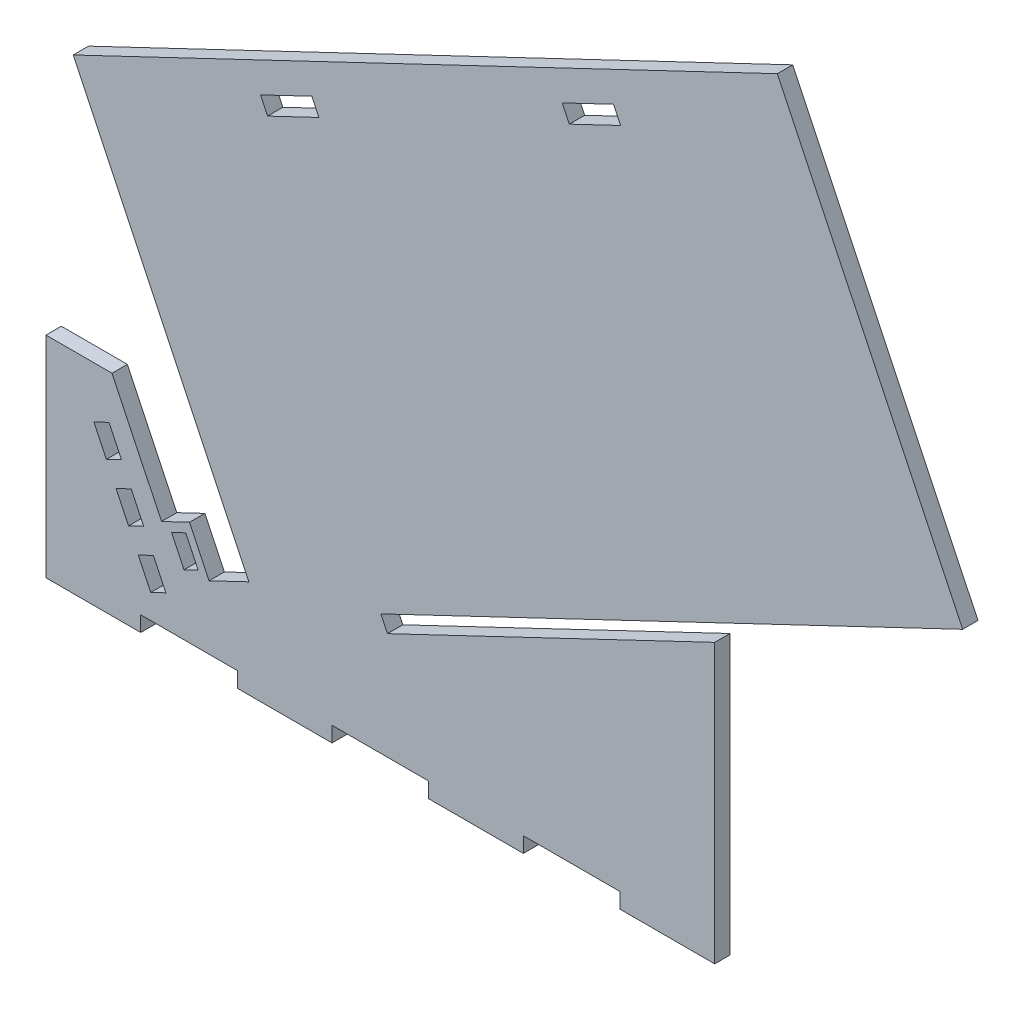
ISO-10303-21;
HEADER;
FILE_DESCRIPTION(('STEP AP214'),'2;1');
FILE_NAME('part.step','',(''),(''),'','','');
FILE_SCHEMA(('AUTOMOTIVE_DESIGN { 1 0 10303 214 1 1 1 1 }'));
ENDSEC;
DATA;
#1=APPLICATION_CONTEXT('core data for automotive mechanical design processes');
#2=APPLICATION_PROTOCOL_DEFINITION('international standard','automotive_design',2000,#1);
#3=PRODUCT_CONTEXT('',#1,'mechanical');
#4=PRODUCT('Part','Part','',(#3));
#5=PRODUCT_RELATED_PRODUCT_CATEGORY('part','',(#4));
#6=PRODUCT_DEFINITION_FORMATION('','',#4);
#7=PRODUCT_DEFINITION_CONTEXT('part definition',#1,'design');
#8=PRODUCT_DEFINITION('design','',#6,#7);
#9=PRODUCT_DEFINITION_SHAPE('','',#8);
#10=(LENGTH_UNIT() NAMED_UNIT(*) SI_UNIT(.MILLI.,.METRE.));
#11=(NAMED_UNIT(*) PLANE_ANGLE_UNIT() SI_UNIT($,.RADIAN.));
#12=(NAMED_UNIT(*) SI_UNIT($,.STERADIAN.) SOLID_ANGLE_UNIT());
#13=UNCERTAINTY_MEASURE_WITH_UNIT(LENGTH_MEASURE(1.E-05),#10,'distance_accuracy_value','');
#14=(GEOMETRIC_REPRESENTATION_CONTEXT(3) GLOBAL_UNCERTAINTY_ASSIGNED_CONTEXT((#13)) GLOBAL_UNIT_ASSIGNED_CONTEXT((#10,
#11,#12)) REPRESENTATION_CONTEXT('',''));
#15=CARTESIAN_POINT('',(0.,0.,0.));
#16=DIRECTION('',(0.,0.,1.));
#17=DIRECTION('',(1.,0.,0.));
#18=AXIS2_PLACEMENT_3D('',#15,#16,#17);
#19=CARTESIAN_POINT('',(-13.212270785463,27.7001017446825,5.5));
#20=DIRECTION('',(0.430511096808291,-0.902585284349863,0.));
#21=DIRECTION('',(0.902585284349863,0.430511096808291,0.));
#22=AXIS2_PLACEMENT_3D('',#19,#20,#21);
#23=PLANE('',#22);
#24=DIRECTION('',(-0.902585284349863,-0.430511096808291,0.));
#25=VECTOR('',#24,1.);
#26=CARTESIAN_POINT('',(-13.212270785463,27.7001017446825,0.));
#27=LINE('',#26,#25);
#28=CARTESIAN_POINT('',(-209.674527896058,-66.0075879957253,0.));
#29=VERTEX_POINT('',#28);
#30=CARTESIAN_POINT('',(-214.729005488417,-68.4184501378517,0.));
#31=VERTEX_POINT('',#30);
#32=EDGE_CURVE('E502',#29,#31,#27,.T.);
#33=ORIENTED_EDGE('',*,*,#32,.T.);
#34=DIRECTION('',(0.,0.,-1.));
#35=VECTOR('',#34,1.);
#36=CARTESIAN_POINT('',(-214.729005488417,-68.4184501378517,5.5));
#37=LINE('',#36,#35);
#38=CARTESIAN_POINT('',(-214.729005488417,-68.4184501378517,5.5));
#39=VERTEX_POINT('',#38);
#40=EDGE_CURVE('E11',#39,#31,#37,.T.);
#41=ORIENTED_EDGE('',*,*,#40,.F.);
#42=DIRECTION('',(-0.902585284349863,-0.430511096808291,0.));
#43=VECTOR('',#42,1.);
#44=CARTESIAN_POINT('',(-13.212270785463,27.7001017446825,5.5));
#45=LINE('',#44,#43);
#46=CARTESIAN_POINT('',(-209.674527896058,-66.0075879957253,5.5));
#47=VERTEX_POINT('',#46);
#48=EDGE_CURVE('E372',#47,#39,#45,.T.);
#49=ORIENTED_EDGE('',*,*,#48,.F.);
#50=DIRECTION('',(0.,0.,-1.));
#51=VECTOR('',#50,1.);
#52=CARTESIAN_POINT('',(-209.674527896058,-66.0075879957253,5.5));
#53=LINE('',#52,#51);
#54=EDGE_CURVE('E509',#47,#29,#53,.T.);
#55=ORIENTED_EDGE('',*,*,#54,.T.);
#56=EDGE_LOOP('',(#33,#41,#49,#55));
#57=FACE_BOUND('',#56,.T.);
#58=ADVANCED_FACE('F39',(#57),#23,.F.);
#59=CARTESIAN_POINT('',(-201.516734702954,-96.1185518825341,5.5));
#60=DIRECTION('',(-0.902585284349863,-0.43051109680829,0.));
#61=DIRECTION('',(0.43051109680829,-0.902585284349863,0.));
#62=AXIS2_PLACEMENT_3D('',#59,#60,#61);
#63=PLANE('',#62);
#64=DIRECTION('',(-0.43051109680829,0.902585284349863,0.));
#65=VECTOR('',#64,1.);
#66=CARTESIAN_POINT('',(-201.516734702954,-96.1185518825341,0.));
#67=LINE('',#66,#65);
#68=CARTESIAN_POINT('',(-219.206320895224,-59.0315631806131,0.));
#69=VERTEX_POINT('',#68);
#70=EDGE_CURVE('E377',#31,#69,#67,.T.);
#71=ORIENTED_EDGE('',*,*,#70,.T.);
#72=DIRECTION('',(0.,0.,-1.));
#73=VECTOR('',#72,1.);
#74=CARTESIAN_POINT('',(-219.206320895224,-59.0315631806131,5.5));
#75=LINE('',#74,#73);
#76=CARTESIAN_POINT('',(-219.206320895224,-59.0315631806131,5.5));
#77=VERTEX_POINT('',#76);
#78=EDGE_CURVE('E49',#77,#69,#75,.T.);
#79=ORIENTED_EDGE('',*,*,#78,.F.);
#80=DIRECTION('',(-0.43051109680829,0.902585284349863,0.));
#81=VECTOR('',#80,1.);
#82=CARTESIAN_POINT('',(-201.516734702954,-96.1185518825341,5.5));
#83=LINE('',#82,#81);
#84=EDGE_CURVE('E366',#39,#77,#83,.T.);
#85=ORIENTED_EDGE('',*,*,#84,.F.);
#86=ORIENTED_EDGE('',*,*,#40,.T.);
#87=EDGE_LOOP('',(#71,#79,#85,#86));
#88=FACE_BOUND('',#87,.T.);
#89=ADVANCED_FACE('F376',(#88),#63,.F.);
#90=CARTESIAN_POINT('',(-17.6895861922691,37.0869887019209,5.5));
#91=DIRECTION('',(-0.43051109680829,0.902585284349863,0.));
#92=DIRECTION('',(-0.902585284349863,-0.43051109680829,0.));
#93=AXIS2_PLACEMENT_3D('',#90,#91,#92);
#94=PLANE('',#93);
#95=DIRECTION('',(0.902585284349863,0.43051109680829,0.));
#96=VECTOR('',#95,1.);
#97=CARTESIAN_POINT('',(-17.6895861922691,37.0869887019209,0.));
#98=LINE('',#97,#96);
#99=CARTESIAN_POINT('',(-214.151843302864,-56.6207010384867,0.));
#100=VERTEX_POINT('',#99);
#101=EDGE_CURVE('E213',#69,#100,#98,.T.);
#102=ORIENTED_EDGE('',*,*,#101,.T.);
#103=DIRECTION('',(0.,0.,-1.));
#104=VECTOR('',#103,1.);
#105=CARTESIAN_POINT('',(-214.151843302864,-56.6207010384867,5.5));
#106=LINE('',#105,#104);
#107=CARTESIAN_POINT('',(-214.151843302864,-56.6207010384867,5.5));
#108=VERTEX_POINT('',#107);
#109=EDGE_CURVE('E378',#108,#100,#106,.T.);
#110=ORIENTED_EDGE('',*,*,#109,.F.);
#111=DIRECTION('',(0.902585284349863,0.43051109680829,0.));
#112=VECTOR('',#111,1.);
#113=CARTESIAN_POINT('',(-17.6895861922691,37.0869887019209,5.5));
#114=LINE('',#113,#112);
#115=EDGE_CURVE('E370',#77,#108,#114,.T.);
#116=ORIENTED_EDGE('',*,*,#115,.F.);
#117=ORIENTED_EDGE('',*,*,#78,.T.);
#118=EDGE_LOOP('',(#102,#110,#116,#117));
#119=FACE_BOUND('',#118,.T.);
#120=ADVANCED_FACE('F380',(#119),#94,.F.);
#121=CARTESIAN_POINT('',(-70.8228816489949,148.483259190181,5.5));
#122=DIRECTION('',(-0.430511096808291,0.902585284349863,0.));
#123=DIRECTION('',(-0.902585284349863,-0.430511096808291,0.));
#124=AXIS2_PLACEMENT_3D('',#121,#122,#123);
#125=PLANE('',#124);
#126=DIRECTION('',(0.902585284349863,0.430511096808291,0.));
#127=VECTOR('',#126,1.);
#128=CARTESIAN_POINT('',(-70.8228816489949,148.483259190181,0.));
#129=LINE('',#128,#127);
#130=CARTESIAN_POINT('',(-78.9643175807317,144.599993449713,0.));
#131=VERTEX_POINT('',#130);
#132=CARTESIAN_POINT('',(-60.5515777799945,153.382419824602,0.));
#133=VERTEX_POINT('',#132);
#134=EDGE_CURVE('E493',#131,#133,#129,.T.);
#135=ORIENTED_EDGE('',*,*,#134,.T.);
#136=DIRECTION('',(0.,0.,-1.));
#137=VECTOR('',#136,1.);
#138=CARTESIAN_POINT('',(-60.5515777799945,153.382419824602,5.5));
#139=LINE('',#138,#137);
#140=CARTESIAN_POINT('',(-60.5515777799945,153.382419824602,5.5));
#141=VERTEX_POINT('',#140);
#142=EDGE_CURVE('E511',#141,#133,#139,.T.);
#143=ORIENTED_EDGE('',*,*,#142,.F.);
#144=DIRECTION('',(0.902585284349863,0.430511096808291,0.));
#145=VECTOR('',#144,1.);
#146=CARTESIAN_POINT('',(-70.8228816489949,148.483259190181,5.5));
#147=LINE('',#146,#145);
#148=CARTESIAN_POINT('',(-78.9643175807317,144.599993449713,5.5));
#149=VERTEX_POINT('',#148);
#150=EDGE_CURVE('E748',#149,#141,#147,.T.);
#151=ORIENTED_EDGE('',*,*,#150,.F.);
#152=DIRECTION('',(0.,0.,-1.));
#153=VECTOR('',#152,1.);
#154=CARTESIAN_POINT('',(-78.9643175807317,144.599993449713,5.5));
#155=LINE('',#154,#153);
#156=EDGE_CURVE('E513',#149,#131,#155,.T.);
#157=ORIENTED_EDGE('',*,*,#156,.T.);
#158=EDGE_LOOP('',(#135,#143,#151,#157));
#159=FACE_BOUND('',#158,.T.);
#160=ADVANCED_FACE('F768',(#159),#125,.F.);
#161=CARTESIAN_POINT('',(10.2713038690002,4.89916063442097,5.5));
#162=DIRECTION('',(0.902585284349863,0.43051109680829,0.));
#163=DIRECTION('',(-0.43051109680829,0.902585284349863,0.));
#164=AXIS2_PLACEMENT_3D('',#161,#162,#163);
#165=PLANE('',#164);
#166=DIRECTION('',(0.43051109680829,-0.902585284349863,0.));
#167=VECTOR('',#166,1.);
#168=CARTESIAN_POINT('',(10.2713038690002,4.89916063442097,0.));
#169=LINE('',#168,#167);
#170=CARTESIAN_POINT('',(-58.0115623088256,148.057166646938,0.));
#171=VERTEX_POINT('',#170);
#172=EDGE_CURVE('E496',#133,#171,#169,.T.);
#173=ORIENTED_EDGE('',*,*,#172,.T.);
#174=DIRECTION('',(0.,0.,-1.));
#175=VECTOR('',#174,1.);
#176=CARTESIAN_POINT('',(-58.0115623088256,148.057166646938,5.5));
#177=LINE('',#176,#175);
#178=CARTESIAN_POINT('',(-58.0115623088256,148.057166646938,5.5));
#179=VERTEX_POINT('',#178);
#180=EDGE_CURVE('E520',#179,#171,#177,.T.);
#181=ORIENTED_EDGE('',*,*,#180,.F.);
#182=DIRECTION('',(0.43051109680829,-0.902585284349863,0.));
#183=VECTOR('',#182,1.);
#184=CARTESIAN_POINT('',(10.2713038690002,4.89916063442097,5.5));
#185=LINE('',#184,#183);
#186=EDGE_CURVE('E751',#141,#179,#185,.T.);
#187=ORIENTED_EDGE('',*,*,#186,.F.);
#188=ORIENTED_EDGE('',*,*,#142,.T.);
#189=EDGE_LOOP('',(#173,#181,#187,#188));
#190=FACE_BOUND('',#189,.T.);
#191=ADVANCED_FACE('F770',(#190),#165,.F.);
#192=CARTESIAN_POINT('',(-68.2828661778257,143.158006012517,5.5));
#193=DIRECTION('',(0.43051109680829,-0.902585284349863,0.));
#194=DIRECTION('',(0.902585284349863,0.43051109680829,0.));
#195=AXIS2_PLACEMENT_3D('',#192,#193,#194);
#196=PLANE('',#195);
#197=DIRECTION('',(-0.902585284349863,-0.43051109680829,0.));
#198=VECTOR('',#197,1.);
#199=CARTESIAN_POINT('',(-68.2828661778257,143.158006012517,0.));
#200=LINE('',#199,#198);
#201=CARTESIAN_POINT('',(-76.4243021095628,139.274740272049,0.));
#202=VERTEX_POINT('',#201);
#203=EDGE_CURVE('E498',#171,#202,#200,.T.);
#204=ORIENTED_EDGE('',*,*,#203,.T.);
#205=DIRECTION('',(0.,0.,-1.));
#206=VECTOR('',#205,1.);
#207=CARTESIAN_POINT('',(-76.4243021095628,139.274740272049,5.5));
#208=LINE('',#207,#206);
#209=CARTESIAN_POINT('',(-76.4243021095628,139.274740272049,5.5));
#210=VERTEX_POINT('',#209);
#211=EDGE_CURVE('E516',#210,#202,#208,.T.);
#212=ORIENTED_EDGE('',*,*,#211,.F.);
#213=DIRECTION('',(-0.902585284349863,-0.43051109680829,0.));
#214=VECTOR('',#213,1.);
#215=CARTESIAN_POINT('',(-68.2828661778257,143.158006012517,5.5));
#216=LINE('',#215,#214);
#217=EDGE_CURVE('E753',#179,#210,#216,.T.);
#218=ORIENTED_EDGE('',*,*,#217,.F.);
#219=ORIENTED_EDGE('',*,*,#180,.T.);
#220=EDGE_LOOP('',(#204,#212,#218,#219));
#221=FACE_BOUND('',#220,.T.);
#222=ADVANCED_FACE('F774',(#221),#196,.F.);
#223=CARTESIAN_POINT('',(-10.3791236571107,21.7602852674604,5.5));
#224=DIRECTION('',(0.430511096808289,-0.902585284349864,0.));
#225=DIRECTION('',(0.902585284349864,0.430511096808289,0.));
#226=AXIS2_PLACEMENT_3D('',#223,#224,#225);
#227=PLANE('',#226);
#228=DIRECTION('',(-0.902585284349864,-0.430511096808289,0.));
#229=VECTOR('',#228,1.);
#230=CARTESIAN_POINT('',(-10.3791236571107,21.7602852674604,0.));
#231=LINE('',#230,#229);
#232=CARTESIAN_POINT('',(-221.241214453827,-78.8157728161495,0.));
#233=VERTEX_POINT('',#232);
#234=CARTESIAN_POINT('',(-226.656726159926,-81.3988393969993,0.));
#235=VERTEX_POINT('',#234);
#236=EDGE_CURVE('E484',#233,#235,#231,.T.);
#237=ORIENTED_EDGE('',*,*,#236,.T.);
#238=DIRECTION('',(0.,0.,-1.));
#239=VECTOR('',#238,1.);
#240=CARTESIAN_POINT('',(-226.656726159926,-81.3988393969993,5.5));
#241=LINE('',#240,#239);
#242=CARTESIAN_POINT('',(-226.656726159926,-81.3988393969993,5.5));
#243=VERTEX_POINT('',#242);
#244=EDGE_CURVE('E517',#243,#235,#241,.T.);
#245=ORIENTED_EDGE('',*,*,#244,.F.);
#246=DIRECTION('',(-0.902585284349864,-0.430511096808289,0.));
#247=VECTOR('',#246,1.);
#248=CARTESIAN_POINT('',(-10.3791236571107,21.7602852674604,5.5));
#249=LINE('',#248,#247);
#250=CARTESIAN_POINT('',(-221.241214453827,-78.8157728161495,5.5));
#251=VERTEX_POINT('',#250);
#252=EDGE_CURVE('E739',#251,#243,#249,.T.);
#253=ORIENTED_EDGE('',*,*,#252,.F.);
#254=DIRECTION('',(0.,0.,-1.));
#255=VECTOR('',#254,1.);
#256=CARTESIAN_POINT('',(-221.241214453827,-78.8157728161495,5.5));
#257=LINE('',#256,#255);
#258=EDGE_CURVE('E525',#251,#233,#257,.T.);
#259=ORIENTED_EDGE('',*,*,#258,.T.);
#260=EDGE_LOOP('',(#237,#245,#253,#259));
#261=FACE_BOUND('',#260,.T.);
#262=ADVANCED_FACE('F807',(#261),#227,.F.);
#263=CARTESIAN_POINT('',(-216.277602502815,-103.15912466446,5.5));
#264=DIRECTION('',(-0.902585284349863,-0.43051109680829,0.));
#265=DIRECTION('',(0.43051109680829,-0.902585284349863,0.));
#266=AXIS2_PLACEMENT_3D('',#263,#264,#265);
#267=PLANE('',#266);
#268=DIRECTION('',(-0.43051109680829,0.902585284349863,0.));
#269=VECTOR('',#268,1.);
#270=CARTESIAN_POINT('',(-216.277602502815,-103.15912466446,0.));
#271=LINE('',#270,#269);
#272=CARTESIAN_POINT('',(-231.134041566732,-72.0119524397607,0.));
#273=VERTEX_POINT('',#272);
#274=EDGE_CURVE('E487',#235,#273,#271,.T.);
#275=ORIENTED_EDGE('',*,*,#274,.T.);
#276=DIRECTION('',(0.,0.,-1.));
#277=VECTOR('',#276,1.);
#278=CARTESIAN_POINT('',(-231.134041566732,-72.0119524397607,5.5));
#279=LINE('',#278,#277);
#280=CARTESIAN_POINT('',(-231.134041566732,-72.0119524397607,5.5));
#281=VERTEX_POINT('',#280);
#282=EDGE_CURVE('E532',#281,#273,#279,.T.);
#283=ORIENTED_EDGE('',*,*,#282,.F.);
#284=DIRECTION('',(-0.43051109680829,0.902585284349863,0.));
#285=VECTOR('',#284,1.);
#286=CARTESIAN_POINT('',(-216.277602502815,-103.15912466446,5.5));
#287=LINE('',#286,#285);
#288=EDGE_CURVE('E742',#243,#281,#287,.T.);
#289=ORIENTED_EDGE('',*,*,#288,.F.);
#290=ORIENTED_EDGE('',*,*,#244,.T.);
#291=EDGE_LOOP('',(#275,#283,#289,#290));
#292=FACE_BOUND('',#291,.T.);
#293=ADVANCED_FACE('F820',(#292),#267,.F.);
#294=CARTESIAN_POINT('',(-14.8564390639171,31.1471722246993,5.5));
#295=DIRECTION('',(-0.430511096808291,0.902585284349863,0.));
#296=DIRECTION('',(-0.902585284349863,-0.430511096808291,0.));
#297=AXIS2_PLACEMENT_3D('',#294,#295,#296);
#298=PLANE('',#297);
#299=DIRECTION('',(0.902585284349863,0.430511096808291,0.));
#300=VECTOR('',#299,1.);
#301=CARTESIAN_POINT('',(-14.8564390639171,31.1471722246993,0.));
#302=LINE('',#301,#300);
#303=CARTESIAN_POINT('',(-225.718529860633,-69.4288858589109,0.));
#304=VERTEX_POINT('',#303);
#305=EDGE_CURVE('E489',#273,#304,#302,.T.);
#306=ORIENTED_EDGE('',*,*,#305,.T.);
#307=DIRECTION('',(0.,0.,-1.));
#308=VECTOR('',#307,1.);
#309=CARTESIAN_POINT('',(-225.718529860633,-69.4288858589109,5.5));
#310=LINE('',#309,#308);
#311=CARTESIAN_POINT('',(-225.718529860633,-69.4288858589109,5.5));
#312=VERTEX_POINT('',#311);
#313=EDGE_CURVE('E528',#312,#304,#310,.T.);
#314=ORIENTED_EDGE('',*,*,#313,.F.);
#315=DIRECTION('',(0.902585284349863,0.430511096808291,0.));
#316=VECTOR('',#315,1.);
#317=CARTESIAN_POINT('',(-14.8564390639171,31.1471722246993,5.5));
#318=LINE('',#317,#316);
#319=EDGE_CURVE('E744',#281,#312,#318,.T.);
#320=ORIENTED_EDGE('',*,*,#319,.F.);
#321=ORIENTED_EDGE('',*,*,#282,.T.);
#322=EDGE_LOOP('',(#306,#314,#320,#321));
#323=FACE_BOUND('',#322,.T.);
#324=ADVANCED_FACE('F816',(#323),#298,.F.);
#325=CARTESIAN_POINT('',(-30.7853496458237,64.5428277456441,5.5));
#326=DIRECTION('',(-0.43051109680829,0.902585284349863,0.));
#327=DIRECTION('',(-0.902585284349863,-0.43051109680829,0.));
#328=AXIS2_PLACEMENT_3D('',#325,#326,#327);
#329=PLANE('',#328);
#330=DIRECTION('',(0.902585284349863,0.43051109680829,0.));
#331=VECTOR('',#330,1.);
#332=CARTESIAN_POINT('',(-30.7853496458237,64.5428277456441,0.));
#333=LINE('',#332,#331);
#334=CARTESIAN_POINT('',(-247.062952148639,-38.6162969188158,0.));
#335=VERTEX_POINT('',#334);
#336=CARTESIAN_POINT('',(-241.64744044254,-36.033230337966,0.));
#337=VERTEX_POINT('',#336);
#338=EDGE_CURVE('E475',#335,#337,#333,.T.);
#339=ORIENTED_EDGE('',*,*,#338,.T.);
#340=DIRECTION('',(0.,0.,-1.));
#341=VECTOR('',#340,1.);
#342=CARTESIAN_POINT('',(-241.64744044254,-36.033230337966,5.5));
#343=LINE('',#342,#341);
#344=CARTESIAN_POINT('',(-241.64744044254,-36.033230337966,5.5));
#345=VERTEX_POINT('',#344);
#346=EDGE_CURVE('E529',#345,#337,#343,.T.);
#347=ORIENTED_EDGE('',*,*,#346,.F.);
#348=DIRECTION('',(0.902585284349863,0.43051109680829,0.));
#349=VECTOR('',#348,1.);
#350=CARTESIAN_POINT('',(-30.7853496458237,64.5428277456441,5.5));
#351=LINE('',#350,#349);
#352=CARTESIAN_POINT('',(-247.062952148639,-38.6162969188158,5.5));
#353=VERTEX_POINT('',#352);
#354=EDGE_CURVE('E730',#353,#345,#351,.T.);
#355=ORIENTED_EDGE('',*,*,#354,.F.);
#356=DIRECTION('',(0.,0.,-1.));
#357=VECTOR('',#356,1.);
#358=CARTESIAN_POINT('',(-247.062952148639,-38.6162969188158,5.5));
#359=LINE('',#358,#357);
#360=EDGE_CURVE('E537',#353,#335,#359,.T.);
#361=ORIENTED_EDGE('',*,*,#360,.T.);
#362=EDGE_LOOP('',(#339,#347,#355,#361));
#363=FACE_BOUND('',#362,.T.);
#364=ADVANCED_FACE('F819',(#363),#329,.F.);
#365=CARTESIAN_POINT('',(-210.862090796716,-100.57605808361,5.5));
#366=DIRECTION('',(0.902585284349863,0.430511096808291,0.));
#367=DIRECTION('',(-0.430511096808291,0.902585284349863,0.));
#368=AXIS2_PLACEMENT_3D('',#365,#366,#367);
#369=PLANE('',#368);
#370=DIRECTION('',(0.430511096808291,-0.902585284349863,0.));
#371=VECTOR('',#370,1.);
#372=CARTESIAN_POINT('',(-210.862090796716,-100.57605808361,0.));
#373=LINE('',#372,#371);
#374=CARTESIAN_POINT('',(-237.170125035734,-45.4201172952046,0.));
#375=VERTEX_POINT('',#374);
#376=EDGE_CURVE('E478',#337,#375,#373,.T.);
#377=ORIENTED_EDGE('',*,*,#376,.T.);
#378=DIRECTION('',(0.,0.,-1.));
#379=VECTOR('',#378,1.);
#380=CARTESIAN_POINT('',(-237.170125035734,-45.4201172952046,5.5));
#381=LINE('',#380,#379);
#382=CARTESIAN_POINT('',(-237.170125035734,-45.4201172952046,5.5));
#383=VERTEX_POINT('',#382);
#384=EDGE_CURVE('E544',#383,#375,#381,.T.);
#385=ORIENTED_EDGE('',*,*,#384,.F.);
#386=DIRECTION('',(0.430511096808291,-0.902585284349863,0.));
#387=VECTOR('',#386,1.);
#388=CARTESIAN_POINT('',(-210.862090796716,-100.57605808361,5.5));
#389=LINE('',#388,#387);
#390=EDGE_CURVE('E733',#345,#383,#389,.T.);
#391=ORIENTED_EDGE('',*,*,#390,.F.);
#392=ORIENTED_EDGE('',*,*,#346,.T.);
#393=EDGE_LOOP('',(#377,#385,#391,#392));
#394=FACE_BOUND('',#393,.T.);
#395=ADVANCED_FACE('F836',(#394),#369,.F.);
#396=CARTESIAN_POINT('',(-26.3080342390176,55.1559407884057,5.5));
#397=DIRECTION('',(0.430511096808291,-0.902585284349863,0.));
#398=DIRECTION('',(0.902585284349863,0.430511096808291,0.));
#399=AXIS2_PLACEMENT_3D('',#396,#397,#398);
#400=PLANE('',#399);
#401=DIRECTION('',(-0.902585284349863,-0.430511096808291,0.));
#402=VECTOR('',#401,1.);
#403=CARTESIAN_POINT('',(-26.3080342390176,55.1559407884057,0.));
#404=LINE('',#403,#402);
#405=CARTESIAN_POINT('',(-242.585636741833,-48.0031838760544,0.));
#406=VERTEX_POINT('',#405);
#407=EDGE_CURVE('E480',#375,#406,#404,.T.);
#408=ORIENTED_EDGE('',*,*,#407,.T.);
#409=DIRECTION('',(0.,0.,-1.));
#410=VECTOR('',#409,1.);
#411=CARTESIAN_POINT('',(-242.585636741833,-48.0031838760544,5.5));
#412=LINE('',#411,#410);
#413=CARTESIAN_POINT('',(-242.585636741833,-48.0031838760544,5.5));
#414=VERTEX_POINT('',#413);
#415=EDGE_CURVE('E540',#414,#406,#412,.T.);
#416=ORIENTED_EDGE('',*,*,#415,.F.);
#417=DIRECTION('',(-0.902585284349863,-0.430511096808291,0.));
#418=VECTOR('',#417,1.);
#419=CARTESIAN_POINT('',(-26.3080342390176,55.1559407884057,5.5));
#420=LINE('',#419,#418);
#421=EDGE_CURVE('E735',#383,#414,#420,.T.);
#422=ORIENTED_EDGE('',*,*,#421,.F.);
#423=ORIENTED_EDGE('',*,*,#384,.T.);
#424=EDGE_LOOP('',(#408,#416,#422,#423));
#425=FACE_BOUND('',#424,.T.);
#426=ADVANCED_FACE('F832',(#425),#400,.F.);
#427=CARTESIAN_POINT('',(-22.8208943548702,47.8449999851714,5.5));
#428=DIRECTION('',(-0.430511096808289,0.902585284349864,0.));
#429=DIRECTION('',(-0.902585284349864,-0.430511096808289,0.));
#430=AXIS2_PLACEMENT_3D('',#427,#428,#429);
#431=PLANE('',#430);
#432=DIRECTION('',(0.902585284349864,0.430511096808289,0.));
#433=VECTOR('',#432,1.);
#434=CARTESIAN_POINT('',(-22.8208943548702,47.8449999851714,0.));
#435=LINE('',#434,#433);
#436=CARTESIAN_POINT('',(-239.098496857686,-55.3141246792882,0.));
#437=VERTEX_POINT('',#436);
#438=CARTESIAN_POINT('',(-233.682985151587,-52.7310580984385,0.));
#439=VERTEX_POINT('',#438);
#440=EDGE_CURVE('E466',#437,#439,#435,.T.);
#441=ORIENTED_EDGE('',*,*,#440,.T.);
#442=DIRECTION('',(0.,0.,-1.));
#443=VECTOR('',#442,1.);
#444=CARTESIAN_POINT('',(-233.682985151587,-52.7310580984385,5.5));
#445=LINE('',#444,#443);
#446=CARTESIAN_POINT('',(-233.682985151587,-52.7310580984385,5.5));
#447=VERTEX_POINT('',#446);
#448=EDGE_CURVE('E541',#447,#439,#445,.T.);
#449=ORIENTED_EDGE('',*,*,#448,.F.);
#450=DIRECTION('',(0.902585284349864,0.430511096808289,0.));
#451=VECTOR('',#450,1.);
#452=CARTESIAN_POINT('',(-22.8208943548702,47.8449999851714,5.5));
#453=LINE('',#452,#451);
#454=CARTESIAN_POINT('',(-239.098496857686,-55.3141246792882,5.5));
#455=VERTEX_POINT('',#454);
#456=EDGE_CURVE('E721',#455,#447,#453,.T.);
#457=ORIENTED_EDGE('',*,*,#456,.F.);
#458=DIRECTION('',(0.,0.,-1.));
#459=VECTOR('',#458,1.);
#460=CARTESIAN_POINT('',(-239.098496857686,-55.3141246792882,5.5));
#461=LINE('',#460,#459);
#462=EDGE_CURVE('E549',#455,#437,#461,.T.);
#463=ORIENTED_EDGE('',*,*,#462,.T.);
#464=EDGE_LOOP('',(#441,#449,#457,#463));
#465=FACE_BOUND('',#464,.T.);
#466=ADVANCED_FACE('F835',(#465),#431,.F.);
#467=CARTESIAN_POINT('',(-210.862090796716,-100.57605808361,5.5));
#468=DIRECTION('',(0.902585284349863,0.43051109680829,0.));
#469=DIRECTION('',(-0.43051109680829,0.902585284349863,0.));
#470=AXIS2_PLACEMENT_3D('',#467,#468,#469);
#471=PLANE('',#470);
#472=DIRECTION('',(0.43051109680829,-0.902585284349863,0.));
#473=VECTOR('',#472,1.);
#474=CARTESIAN_POINT('',(-210.862090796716,-100.57605808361,0.));
#475=LINE('',#474,#473);
#476=CARTESIAN_POINT('',(-229.20566974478,-62.1179450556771,0.));
#477=VERTEX_POINT('',#476);
#478=EDGE_CURVE('E469',#439,#477,#475,.T.);
#479=ORIENTED_EDGE('',*,*,#478,.T.);
#480=DIRECTION('',(0.,0.,-1.));
#481=VECTOR('',#480,1.);
#482=CARTESIAN_POINT('',(-229.20566974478,-62.1179450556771,5.5));
#483=LINE('',#482,#481);
#484=CARTESIAN_POINT('',(-229.20566974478,-62.1179450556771,5.5));
#485=VERTEX_POINT('',#484);
#486=EDGE_CURVE('E556',#485,#477,#483,.T.);
#487=ORIENTED_EDGE('',*,*,#486,.F.);
#488=DIRECTION('',(0.43051109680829,-0.902585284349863,0.));
#489=VECTOR('',#488,1.);
#490=CARTESIAN_POINT('',(-210.862090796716,-100.57605808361,5.5));
#491=LINE('',#490,#489);
#492=EDGE_CURVE('E724',#447,#485,#491,.T.);
#493=ORIENTED_EDGE('',*,*,#492,.F.);
#494=ORIENTED_EDGE('',*,*,#448,.T.);
#495=EDGE_LOOP('',(#479,#487,#493,#494));
#496=FACE_BOUND('',#495,.T.);
#497=ADVANCED_FACE('F851',(#496),#471,.F.);
#498=CARTESIAN_POINT('',(-18.3435789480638,38.4581130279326,5.5));
#499=DIRECTION('',(0.430511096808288,-0.902585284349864,0.));
#500=DIRECTION('',(0.902585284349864,0.430511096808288,0.));
#501=AXIS2_PLACEMENT_3D('',#498,#499,#500);
#502=PLANE('',#501);
#503=DIRECTION('',(-0.902585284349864,-0.430511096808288,0.));
#504=VECTOR('',#503,1.);
#505=CARTESIAN_POINT('',(-18.3435789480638,38.4581130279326,0.));
#506=LINE('',#505,#504);
#507=CARTESIAN_POINT('',(-234.62118145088,-64.7010116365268,0.));
#508=VERTEX_POINT('',#507);
#509=EDGE_CURVE('E471',#477,#508,#506,.T.);
#510=ORIENTED_EDGE('',*,*,#509,.T.);
#511=DIRECTION('',(0.,0.,-1.));
#512=VECTOR('',#511,1.);
#513=CARTESIAN_POINT('',(-234.62118145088,-64.7010116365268,5.5));
#514=LINE('',#513,#512);
#515=CARTESIAN_POINT('',(-234.62118145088,-64.7010116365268,5.5));
#516=VERTEX_POINT('',#515);
#517=EDGE_CURVE('E552',#516,#508,#514,.T.);
#518=ORIENTED_EDGE('',*,*,#517,.F.);
#519=DIRECTION('',(-0.902585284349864,-0.430511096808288,0.));
#520=VECTOR('',#519,1.);
#521=CARTESIAN_POINT('',(-18.3435789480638,38.4581130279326,5.5));
#522=LINE('',#521,#520);
#523=EDGE_CURVE('E726',#485,#516,#522,.T.);
#524=ORIENTED_EDGE('',*,*,#523,.F.);
#525=ORIENTED_EDGE('',*,*,#486,.T.);
#526=EDGE_LOOP('',(#510,#518,#524,#525));
#527=FACE_BOUND('',#526,.T.);
#528=ADVANCED_FACE('F847',(#527),#502,.F.);
#529=CARTESIAN_POINT('',(-70.8228816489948,148.483259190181,5.5));
#530=DIRECTION('',(-0.43051109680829,0.902585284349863,0.));
#531=DIRECTION('',(-0.902585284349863,-0.43051109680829,0.));
#532=AXIS2_PLACEMENT_3D('',#529,#530,#531);
#533=PLANE('',#532);
#534=DIRECTION('',(0.902585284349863,0.43051109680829,0.));
#535=VECTOR('',#534,1.);
#536=CARTESIAN_POINT('',(-70.8228816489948,148.483259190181,0.));
#537=LINE('',#536,#535);
#538=CARTESIAN_POINT('',(-187.274551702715,92.9386618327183,0.));
#539=VERTEX_POINT('',#538);
#540=CARTESIAN_POINT('',(-168.861811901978,101.721088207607,0.));
#541=VERTEX_POINT('',#540);
#542=EDGE_CURVE('E457',#539,#541,#537,.T.);
#543=ORIENTED_EDGE('',*,*,#542,.T.);
#544=DIRECTION('',(0.,0.,-1.));
#545=VECTOR('',#544,1.);
#546=CARTESIAN_POINT('',(-168.861811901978,101.721088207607,5.5));
#547=LINE('',#546,#545);
#548=CARTESIAN_POINT('',(-168.861811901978,101.721088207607,5.5));
#549=VERTEX_POINT('',#548);
#550=EDGE_CURVE('E553',#549,#541,#547,.T.);
#551=ORIENTED_EDGE('',*,*,#550,.F.);
#552=DIRECTION('',(0.902585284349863,0.43051109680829,0.));
#553=VECTOR('',#552,1.);
#554=CARTESIAN_POINT('',(-70.8228816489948,148.483259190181,5.5));
#555=LINE('',#554,#553);
#556=CARTESIAN_POINT('',(-187.274551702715,92.9386618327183,5.5));
#557=VERTEX_POINT('',#556);
#558=EDGE_CURVE('E712',#557,#549,#555,.T.);
#559=ORIENTED_EDGE('',*,*,#558,.F.);
#560=DIRECTION('',(0.,0.,-1.));
#561=VECTOR('',#560,1.);
#562=CARTESIAN_POINT('',(-187.274551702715,92.9386618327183,5.5));
#563=LINE('',#562,#561);
#564=EDGE_CURVE('E561',#557,#539,#563,.T.);
#565=ORIENTED_EDGE('',*,*,#564,.T.);
#566=EDGE_LOOP('',(#543,#551,#559,#565));
#567=FACE_BOUND('',#566,.T.);
#568=ADVANCED_FACE('F850',(#567),#533,.F.);
#569=CARTESIAN_POINT('',(-98.0389302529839,-46.7621709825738,5.5));
#570=DIRECTION('',(0.902585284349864,0.430511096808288,0.));
#571=DIRECTION('',(-0.430511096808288,0.902585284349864,0.));
#572=AXIS2_PLACEMENT_3D('',#569,#570,#571);
#573=PLANE('',#572);
#574=DIRECTION('',(0.430511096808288,-0.902585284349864,0.));
#575=VECTOR('',#574,1.);
#576=CARTESIAN_POINT('',(-98.0389302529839,-46.7621709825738,0.));
#577=LINE('',#576,#575);
#578=CARTESIAN_POINT('',(-166.321796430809,96.3958350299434,0.));
#579=VERTEX_POINT('',#578);
#580=EDGE_CURVE('E460',#541,#579,#577,.T.);
#581=ORIENTED_EDGE('',*,*,#580,.T.);
#582=DIRECTION('',(0.,0.,-1.));
#583=VECTOR('',#582,1.);
#584=CARTESIAN_POINT('',(-166.321796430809,96.3958350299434,5.5));
#585=LINE('',#584,#583);
#586=CARTESIAN_POINT('',(-166.321796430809,96.3958350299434,5.5));
#587=VERTEX_POINT('',#586);
#588=EDGE_CURVE('E567',#587,#579,#585,.T.);
#589=ORIENTED_EDGE('',*,*,#588,.F.);
#590=DIRECTION('',(0.430511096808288,-0.902585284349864,0.));
#591=VECTOR('',#590,1.);
#592=CARTESIAN_POINT('',(-98.0389302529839,-46.7621709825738,5.5));
#593=LINE('',#592,#591);
#594=EDGE_CURVE('E715',#549,#587,#593,.T.);
#595=ORIENTED_EDGE('',*,*,#594,.F.);
#596=ORIENTED_EDGE('',*,*,#550,.T.);
#597=EDGE_LOOP('',(#581,#589,#595,#596));
#598=FACE_BOUND('',#597,.T.);
#599=ADVANCED_FACE('F865',(#598),#573,.F.);
#600=CARTESIAN_POINT('',(-68.2828661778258,143.158006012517,5.5));
#601=DIRECTION('',(0.43051109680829,-0.902585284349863,0.));
#602=DIRECTION('',(0.902585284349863,0.43051109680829,0.));
#603=AXIS2_PLACEMENT_3D('',#600,#601,#602);
#604=PLANE('',#603);
#605=DIRECTION('',(-0.902585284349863,-0.43051109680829,0.));
#606=VECTOR('',#605,1.);
#607=CARTESIAN_POINT('',(-68.2828661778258,143.158006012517,0.));
#608=LINE('',#607,#606);
#609=CARTESIAN_POINT('',(-184.734536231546,87.6134086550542,0.));
#610=VERTEX_POINT('',#609);
#611=EDGE_CURVE('E462',#579,#610,#608,.T.);
#612=ORIENTED_EDGE('',*,*,#611,.T.);
#613=DIRECTION('',(0.,0.,-1.));
#614=VECTOR('',#613,1.);
#615=CARTESIAN_POINT('',(-184.734536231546,87.6134086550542,5.5));
#616=LINE('',#615,#614);
#617=CARTESIAN_POINT('',(-184.734536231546,87.6134086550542,5.5));
#618=VERTEX_POINT('',#617);
#619=EDGE_CURVE('E564',#618,#610,#616,.T.);
#620=ORIENTED_EDGE('',*,*,#619,.F.);
#621=DIRECTION('',(-0.902585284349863,-0.43051109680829,0.));
#622=VECTOR('',#621,1.);
#623=CARTESIAN_POINT('',(-68.2828661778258,143.158006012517,5.5));
#624=LINE('',#623,#622);
#625=EDGE_CURVE('E717',#587,#618,#624,.T.);
#626=ORIENTED_EDGE('',*,*,#625,.F.);
#627=ORIENTED_EDGE('',*,*,#588,.T.);
#628=EDGE_LOOP('',(#612,#620,#626,#627));
#629=FACE_BOUND('',#628,.T.);
#630=ADVANCED_FACE('F862',(#629),#604,.F.);
#631=CARTESIAN_POINT('',(-193.754499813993,-92.4161583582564,5.5));
#632=DIRECTION('',(0.902585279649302,0.430511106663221,0.));
#633=DIRECTION('',(-0.430511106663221,0.902585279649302,0.));
#634=AXIS2_PLACEMENT_3D('',#631,#632,#633);
#635=PLANE('',#634);
#636=DIRECTION('',(0.430511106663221,-0.902585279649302,0.));
#637=VECTOR('',#636,1.);
#638=CARTESIAN_POINT('',(-193.754499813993,-92.4161583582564,0.));
#639=LINE('',#638,#637);
#640=CARTESIAN_POINT('',(-212.73562074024,-52.6214118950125,0.));
#641=VERTEX_POINT('',#640);
#642=CARTESIAN_POINT('',(-205.727558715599,-67.3141190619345,0.));
#643=VERTEX_POINT('',#642);
#644=EDGE_CURVE('E386',#641,#643,#639,.T.);
#645=ORIENTED_EDGE('',*,*,#644,.F.);
#646=DIRECTION('',(0.,0.,-1.));
#647=VECTOR('',#646,1.);
#648=CARTESIAN_POINT('',(-212.73562074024,-52.6214118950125,5.5));
#649=LINE('',#648,#647);
#650=CARTESIAN_POINT('',(-212.73562074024,-52.6214118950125,5.5));
#651=VERTEX_POINT('',#650);
#652=EDGE_CURVE('E43',#651,#641,#649,.T.);
#653=ORIENTED_EDGE('',*,*,#652,.F.);
#654=DIRECTION('',(0.430511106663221,-0.902585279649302,0.));
#655=VECTOR('',#654,1.);
#656=CARTESIAN_POINT('',(-193.754499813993,-92.4161583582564,5.5));
#657=LINE('',#656,#655);
#658=CARTESIAN_POINT('',(-205.727558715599,-67.3141190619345,5.5));
#659=VERTEX_POINT('',#658);
#660=EDGE_CURVE('E508',#651,#659,#657,.T.);
#661=ORIENTED_EDGE('',*,*,#660,.T.);
#662=DIRECTION('',(0.,0.,-1.));
#663=VECTOR('',#662,1.);
#664=CARTESIAN_POINT('',(-205.727558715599,-67.3141190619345,5.5));
#665=LINE('',#664,#663);
#666=EDGE_CURVE('E382',#659,#643,#665,.T.);
#667=ORIENTED_EDGE('',*,*,#666,.T.);
#668=EDGE_LOOP('',(#645,#653,#661,#667));
#669=FACE_BOUND('',#668,.T.);
#670=ADVANCED_FACE('F41',(#669),#635,.T.);
#671=CARTESIAN_POINT('',(-18.9811194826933,39.7947445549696,5.5));
#672=DIRECTION('',(-0.430511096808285,0.902585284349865,0.));
#673=DIRECTION('',(-0.902585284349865,-0.430511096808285,0.));
#674=AXIS2_PLACEMENT_3D('',#671,#672,#673);
#675=PLANE('',#674);
#676=DIRECTION('',(0.902585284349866,0.430511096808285,0.));
#677=VECTOR('',#676,1.);
#678=CARTESIAN_POINT('',(-18.9811194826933,39.7947445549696,0.));
#679=LINE('',#678,#677);
#680=CARTESIAN_POINT('',(-222.803045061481,-57.4233269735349,0.));
#681=VERTEX_POINT('',#680);
#682=EDGE_CURVE('E389',#681,#641,#679,.T.);
#683=ORIENTED_EDGE('',*,*,#682,.F.);
#684=DIRECTION('',(0.,0.,-1.));
#685=VECTOR('',#684,1.);
#686=CARTESIAN_POINT('',(-222.803045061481,-57.4233269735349,5.5));
#687=LINE('',#686,#685);
#688=CARTESIAN_POINT('',(-222.803045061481,-57.4233269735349,5.5));
#689=VERTEX_POINT('',#688);
#690=EDGE_CURVE('E625',#689,#681,#687,.T.);
#691=ORIENTED_EDGE('',*,*,#690,.F.);
#692=DIRECTION('',(0.902585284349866,0.430511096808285,0.));
#693=VECTOR('',#692,1.);
#694=CARTESIAN_POINT('',(-18.9811194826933,39.7947445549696,5.5));
#695=LINE('',#694,#693);
#696=EDGE_CURVE('E634',#689,#651,#695,.T.);
#697=ORIENTED_EDGE('',*,*,#696,.T.);
#698=ORIENTED_EDGE('',*,*,#652,.T.);
#699=EDGE_LOOP('',(#683,#691,#697,#698));
#700=FACE_BOUND('',#699,.T.);
#701=ADVANCED_FACE('F632',(#700),#675,.T.);
#702=CARTESIAN_POINT('',(-203.821925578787,-97.2180715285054,5.5));
#703=DIRECTION('',(0.902585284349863,0.43051109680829,0.));
#704=DIRECTION('',(-0.43051109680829,0.902585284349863,0.));
#705=AXIS2_PLACEMENT_3D('',#702,#703,#704);
#706=PLANE('',#705);
#707=DIRECTION('',(0.43051109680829,-0.902585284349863,0.));
#708=VECTOR('',#707,1.);
#709=CARTESIAN_POINT('',(-203.821925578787,-97.2180715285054,0.));
#710=LINE('',#709,#708);
#711=CARTESIAN_POINT('',(-240.553810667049,-20.2080729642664,0.));
#712=VERTEX_POINT('',#711);
#713=EDGE_CURVE('E392',#712,#681,#710,.T.);
#714=ORIENTED_EDGE('',*,*,#713,.F.);
#715=DIRECTION('',(0.,0.,-1.));
#716=VECTOR('',#715,1.);
#717=CARTESIAN_POINT('',(-240.553810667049,-20.2080729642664,5.5));
#718=LINE('',#717,#716);
#719=CARTESIAN_POINT('',(-240.553810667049,-20.2080729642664,5.5));
#720=VERTEX_POINT('',#719);
#721=EDGE_CURVE('E624',#720,#712,#718,.T.);
#722=ORIENTED_EDGE('',*,*,#721,.F.);
#723=DIRECTION('',(0.43051109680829,-0.902585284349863,0.));
#724=VECTOR('',#723,1.);
#725=CARTESIAN_POINT('',(-203.821925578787,-97.2180715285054,5.5));
#726=LINE('',#725,#724);
#727=EDGE_CURVE('E642',#720,#689,#726,.T.);
#728=ORIENTED_EDGE('',*,*,#727,.T.);
#729=ORIENTED_EDGE('',*,*,#690,.T.);
#730=EDGE_LOOP('',(#714,#722,#728,#729));
#731=FACE_BOUND('',#730,.T.);
#732=ADVANCED_FACE('F640',(#731),#706,.T.);
#733=CARTESIAN_POINT('',(0.,-20.2080729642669,5.5));
#734=DIRECTION('',(0.,1.,0.));
#735=DIRECTION('',(-1.,0.,0.));
#736=AXIS2_PLACEMENT_3D('',#733,#734,#735);
#737=PLANE('',#736);
#738=DIRECTION('',(1.,0.,0.));
#739=VECTOR('',#738,1.);
#740=CARTESIAN_POINT('',(0.,-20.2080729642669,0.));
#741=LINE('',#740,#739);
#742=CARTESIAN_POINT('',(-264.257200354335,-20.2080729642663,0.));
#743=VERTEX_POINT('',#742);
#744=EDGE_CURVE('E395',#743,#712,#741,.T.);
#745=ORIENTED_EDGE('',*,*,#744,.F.);
#746=DIRECTION('',(0.,0.,-1.));
#747=VECTOR('',#746,1.);
#748=CARTESIAN_POINT('',(-264.257200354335,-20.2080729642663,5.5));
#749=LINE('',#748,#747);
#750=CARTESIAN_POINT('',(-264.257200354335,-20.2080729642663,5.5));
#751=VERTEX_POINT('',#750);
#752=EDGE_CURVE('E622',#751,#743,#749,.T.);
#753=ORIENTED_EDGE('',*,*,#752,.F.);
#754=DIRECTION('',(1.,0.,0.));
#755=VECTOR('',#754,1.);
#756=CARTESIAN_POINT('',(0.,-20.2080729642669,5.5));
#757=LINE('',#756,#755);
#758=EDGE_CURVE('E649',#751,#720,#757,.T.);
#759=ORIENTED_EDGE('',*,*,#758,.T.);
#760=ORIENTED_EDGE('',*,*,#721,.T.);
#761=EDGE_LOOP('',(#745,#753,#759,#760));
#762=FACE_BOUND('',#761,.T.);
#763=ADVANCED_FACE('F652',(#762),#737,.T.);
#764=CARTESIAN_POINT('',(-264.257200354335,-2.09710098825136E-13,5.5));
#765=DIRECTION('',(-1.,0.,0.));
#766=DIRECTION('',(0.,-1.,0.));
#767=AXIS2_PLACEMENT_3D('',#764,#765,#766);
#768=PLANE('',#767);
#769=DIRECTION('',(0.,1.,0.));
#770=VECTOR('',#769,1.);
#771=CARTESIAN_POINT('',(-264.257200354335,-2.09710098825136E-13,0.));
#772=LINE('',#771,#770);
#773=CARTESIAN_POINT('',(-264.257200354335,-95.6580729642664,0.));
#774=VERTEX_POINT('',#773);
#775=EDGE_CURVE('E398',#774,#743,#772,.T.);
#776=ORIENTED_EDGE('',*,*,#775,.F.);
#777=DIRECTION('',(0.,0.,-1.));
#778=VECTOR('',#777,1.);
#779=CARTESIAN_POINT('',(-264.257200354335,-95.6580729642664,5.5));
#780=LINE('',#779,#778);
#781=CARTESIAN_POINT('',(-264.257200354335,-95.6580729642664,5.5));
#782=VERTEX_POINT('',#781);
#783=EDGE_CURVE('E620',#782,#774,#780,.T.);
#784=ORIENTED_EDGE('',*,*,#783,.F.);
#785=DIRECTION('',(0.,1.,0.));
#786=VECTOR('',#785,1.);
#787=CARTESIAN_POINT('',(-264.257200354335,-2.09710098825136E-13,5.5));
#788=LINE('',#787,#786);
#789=EDGE_CURVE('E653',#782,#751,#788,.T.);
#790=ORIENTED_EDGE('',*,*,#789,.T.);
#791=ORIENTED_EDGE('',*,*,#752,.T.);
#792=EDGE_LOOP('',(#776,#784,#790,#791));
#793=FACE_BOUND('',#792,.T.);
#794=ADVANCED_FACE('F951',(#793),#768,.T.);
#795=CARTESIAN_POINT('',(0.,-95.6580729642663,5.5));
#796=DIRECTION('',(0.,1.,0.));
#797=DIRECTION('',(-1.,0.,0.));
#798=AXIS2_PLACEMENT_3D('',#795,#796,#797);
#799=PLANE('',#798);
#800=DIRECTION('',(1.,0.,0.));
#801=VECTOR('',#800,1.);
#802=CARTESIAN_POINT('',(0.,-95.6580729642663,0.));
#803=LINE('',#802,#801);
#804=CARTESIAN_POINT('',(-230.257200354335,-95.6580729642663,0.));
#805=VERTEX_POINT('',#804);
#806=EDGE_CURVE('E401',#774,#805,#803,.T.);
#807=ORIENTED_EDGE('',*,*,#806,.T.);
#808=DIRECTION('',(0.,0.,-1.));
#809=VECTOR('',#808,1.);
#810=CARTESIAN_POINT('',(-230.257200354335,-95.6580729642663,5.5));
#811=LINE('',#810,#809);
#812=CARTESIAN_POINT('',(-230.257200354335,-95.6580729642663,5.5));
#813=VERTEX_POINT('',#812);
#814=EDGE_CURVE('E617',#813,#805,#811,.T.);
#815=ORIENTED_EDGE('',*,*,#814,.F.);
#816=DIRECTION('',(1.,0.,0.));
#817=VECTOR('',#816,1.);
#818=CARTESIAN_POINT('',(0.,-95.6580729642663,5.5));
#819=LINE('',#818,#817);
#820=EDGE_CURVE('E655',#782,#813,#819,.T.);
#821=ORIENTED_EDGE('',*,*,#820,.F.);
#822=ORIENTED_EDGE('',*,*,#783,.T.);
#823=EDGE_LOOP('',(#807,#815,#821,#822));
#824=FACE_BOUND('',#823,.T.);
#825=ADVANCED_FACE('F947',(#824),#799,.F.);
#826=CARTESIAN_POINT('',(-230.257200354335,0.,5.5));
#827=DIRECTION('',(-1.,0.,0.));
#828=DIRECTION('',(0.,0.,1.));
#829=AXIS2_PLACEMENT_3D('',#826,#827,#828);
#830=PLANE('',#829);
#831=DIRECTION('',(0.,1.,0.));
#832=VECTOR('',#831,1.);
#833=CARTESIAN_POINT('',(-230.257200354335,0.,0.));
#834=LINE('',#833,#832);
#835=CARTESIAN_POINT('',(-230.257200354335,-90.1580729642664,0.));
#836=VERTEX_POINT('',#835);
#837=EDGE_CURVE('E403',#805,#836,#834,.T.);
#838=ORIENTED_EDGE('',*,*,#837,.T.);
#839=DIRECTION('',(0.,0.,-1.));
#840=VECTOR('',#839,1.);
#841=CARTESIAN_POINT('',(-230.257200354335,-90.1580729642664,5.5));
#842=LINE('',#841,#840);
#843=CARTESIAN_POINT('',(-230.257200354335,-90.1580729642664,5.5));
#844=VERTEX_POINT('',#843);
#845=EDGE_CURVE('E614',#844,#836,#842,.T.);
#846=ORIENTED_EDGE('',*,*,#845,.F.);
#847=DIRECTION('',(0.,1.,0.));
#848=VECTOR('',#847,1.);
#849=CARTESIAN_POINT('',(-230.257200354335,0.,5.5));
#850=LINE('',#849,#848);
#851=EDGE_CURVE('E660',#813,#844,#850,.T.);
#852=ORIENTED_EDGE('',*,*,#851,.F.);
#853=ORIENTED_EDGE('',*,*,#814,.T.);
#854=EDGE_LOOP('',(#838,#846,#852,#853));
#855=FACE_BOUND('',#854,.T.);
#856=ADVANCED_FACE('F943',(#855),#830,.F.);
#857=CARTESIAN_POINT('',(1.44396376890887E-13,-90.158072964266,5.5));
#858=DIRECTION('',(0.,1.,0.));
#859=DIRECTION('',(-1.,0.,0.));
#860=AXIS2_PLACEMENT_3D('',#857,#858,#859);
#861=PLANE('',#860);
#862=DIRECTION('',(1.,0.,0.));
#863=VECTOR('',#862,1.);
#864=CARTESIAN_POINT('',(1.44396376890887E-13,-90.158072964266,0.));
#865=LINE('',#864,#863);
#866=CARTESIAN_POINT('',(-195.597200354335,-90.1580729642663,0.));
#867=VERTEX_POINT('',#866);
#868=EDGE_CURVE('E405',#836,#867,#865,.T.);
#869=ORIENTED_EDGE('',*,*,#868,.T.);
#870=DIRECTION('',(0.,0.,-1.));
#871=VECTOR('',#870,1.);
#872=CARTESIAN_POINT('',(-195.597200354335,-90.1580729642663,5.5));
#873=LINE('',#872,#871);
#874=CARTESIAN_POINT('',(-195.597200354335,-90.1580729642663,5.5));
#875=VERTEX_POINT('',#874);
#876=EDGE_CURVE('E611',#875,#867,#873,.T.);
#877=ORIENTED_EDGE('',*,*,#876,.F.);
#878=DIRECTION('',(1.,0.,0.));
#879=VECTOR('',#878,1.);
#880=CARTESIAN_POINT('',(1.44396376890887E-13,-90.158072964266,5.5));
#881=LINE('',#880,#879);
#882=EDGE_CURVE('E662',#844,#875,#881,.T.);
#883=ORIENTED_EDGE('',*,*,#882,.F.);
#884=ORIENTED_EDGE('',*,*,#845,.T.);
#885=EDGE_LOOP('',(#869,#877,#883,#884));
#886=FACE_BOUND('',#885,.T.);
#887=ADVANCED_FACE('F939',(#886),#861,.F.);
#888=CARTESIAN_POINT('',(-195.597200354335,0.,5.5));
#889=DIRECTION('',(1.,0.,0.));
#890=DIRECTION('',(0.,0.,-1.));
#891=AXIS2_PLACEMENT_3D('',#888,#889,#890);
#892=PLANE('',#891);
#893=DIRECTION('',(0.,-1.,0.));
#894=VECTOR('',#893,1.);
#895=CARTESIAN_POINT('',(-195.597200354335,0.,0.));
#896=LINE('',#895,#894);
#897=CARTESIAN_POINT('',(-195.597200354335,-95.6580729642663,0.));
#898=VERTEX_POINT('',#897);
#899=EDGE_CURVE('E407',#867,#898,#896,.T.);
#900=ORIENTED_EDGE('',*,*,#899,.T.);
#901=DIRECTION('',(0.,0.,-1.));
#902=VECTOR('',#901,1.);
#903=CARTESIAN_POINT('',(-195.597200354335,-95.6580729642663,5.5));
#904=LINE('',#903,#902);
#905=CARTESIAN_POINT('',(-195.597200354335,-95.6580729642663,5.5));
#906=VERTEX_POINT('',#905);
#907=EDGE_CURVE('E608',#906,#898,#904,.T.);
#908=ORIENTED_EDGE('',*,*,#907,.F.);
#909=DIRECTION('',(0.,-1.,0.));
#910=VECTOR('',#909,1.);
#911=CARTESIAN_POINT('',(-195.597200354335,0.,5.5));
#912=LINE('',#911,#910);
#913=EDGE_CURVE('E664',#875,#906,#912,.T.);
#914=ORIENTED_EDGE('',*,*,#913,.F.);
#915=ORIENTED_EDGE('',*,*,#876,.T.);
#916=EDGE_LOOP('',(#900,#908,#914,#915));
#917=FACE_BOUND('',#916,.T.);
#918=ADVANCED_FACE('F935',(#917),#892,.F.);
#919=CARTESIAN_POINT('',(0.,-95.6580729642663,5.5));
#920=DIRECTION('',(0.,1.,0.));
#921=DIRECTION('',(0.,0.,1.));
#922=AXIS2_PLACEMENT_3D('',#919,#920,#921);
#923=PLANE('',#922);
#924=DIRECTION('',(1.,0.,0.));
#925=VECTOR('',#924,1.);
#926=CARTESIAN_POINT('',(0.,-95.6580729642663,0.));
#927=LINE('',#926,#925);
#928=CARTESIAN_POINT('',(-161.597200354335,-95.6580729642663,0.));
#929=VERTEX_POINT('',#928);
#930=EDGE_CURVE('E409',#898,#929,#927,.T.);
#931=ORIENTED_EDGE('',*,*,#930,.T.);
#932=DIRECTION('',(0.,0.,-1.));
#933=VECTOR('',#932,1.);
#934=CARTESIAN_POINT('',(-161.597200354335,-95.6580729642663,5.5));
#935=LINE('',#934,#933);
#936=CARTESIAN_POINT('',(-161.597200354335,-95.6580729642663,5.5));
#937=VERTEX_POINT('',#936);
#938=EDGE_CURVE('E605',#937,#929,#935,.T.);
#939=ORIENTED_EDGE('',*,*,#938,.F.);
#940=DIRECTION('',(1.,0.,0.));
#941=VECTOR('',#940,1.);
#942=CARTESIAN_POINT('',(0.,-95.6580729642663,5.5));
#943=LINE('',#942,#941);
#944=EDGE_CURVE('E666',#906,#937,#943,.T.);
#945=ORIENTED_EDGE('',*,*,#944,.F.);
#946=ORIENTED_EDGE('',*,*,#907,.T.);
#947=EDGE_LOOP('',(#931,#939,#945,#946));
#948=FACE_BOUND('',#947,.T.);
#949=ADVANCED_FACE('F931',(#948),#923,.F.);
#950=CARTESIAN_POINT('',(-161.597200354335,0.,5.5));
#951=DIRECTION('',(-1.,0.,0.));
#952=DIRECTION('',(0.,0.,1.));
#953=AXIS2_PLACEMENT_3D('',#950,#951,#952);
#954=PLANE('',#953);
#955=DIRECTION('',(0.,1.,0.));
#956=VECTOR('',#955,1.);
#957=CARTESIAN_POINT('',(-161.597200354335,0.,0.));
#958=LINE('',#957,#956);
#959=CARTESIAN_POINT('',(-161.597200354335,-90.1580729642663,0.));
#960=VERTEX_POINT('',#959);
#961=EDGE_CURVE('E411',#929,#960,#958,.T.);
#962=ORIENTED_EDGE('',*,*,#961,.T.);
#963=DIRECTION('',(0.,0.,-1.));
#964=VECTOR('',#963,1.);
#965=CARTESIAN_POINT('',(-161.597200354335,-90.1580729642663,5.5));
#966=LINE('',#965,#964);
#967=CARTESIAN_POINT('',(-161.597200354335,-90.1580729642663,5.5));
#968=VERTEX_POINT('',#967);
#969=EDGE_CURVE('E602',#968,#960,#966,.T.);
#970=ORIENTED_EDGE('',*,*,#969,.F.);
#971=DIRECTION('',(0.,1.,0.));
#972=VECTOR('',#971,1.);
#973=CARTESIAN_POINT('',(-161.597200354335,0.,5.5));
#974=LINE('',#973,#972);
#975=EDGE_CURVE('E668',#937,#968,#974,.T.);
#976=ORIENTED_EDGE('',*,*,#975,.F.);
#977=ORIENTED_EDGE('',*,*,#938,.T.);
#978=EDGE_LOOP('',(#962,#970,#976,#977));
#979=FACE_BOUND('',#978,.T.);
#980=ADVANCED_FACE('F927',(#979),#954,.F.);
#981=CARTESIAN_POINT('',(0.,-90.1580729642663,5.5));
#982=DIRECTION('',(0.,1.,0.));
#983=DIRECTION('',(0.,0.,1.));
#984=AXIS2_PLACEMENT_3D('',#981,#982,#983);
#985=PLANE('',#984);
#986=DIRECTION('',(1.,0.,0.));
#987=VECTOR('',#986,1.);
#988=CARTESIAN_POINT('',(0.,-90.1580729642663,0.));
#989=LINE('',#988,#987);
#990=CARTESIAN_POINT('',(-126.917200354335,-90.1580729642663,0.));
#991=VERTEX_POINT('',#990);
#992=EDGE_CURVE('E413',#960,#991,#989,.T.);
#993=ORIENTED_EDGE('',*,*,#992,.T.);
#994=DIRECTION('',(0.,0.,-1.));
#995=VECTOR('',#994,1.);
#996=CARTESIAN_POINT('',(-126.917200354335,-90.1580729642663,5.5));
#997=LINE('',#996,#995);
#998=CARTESIAN_POINT('',(-126.917200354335,-90.1580729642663,5.5));
#999=VERTEX_POINT('',#998);
#1000=EDGE_CURVE('E600',#999,#991,#997,.T.);
#1001=ORIENTED_EDGE('',*,*,#1000,.F.);
#1002=DIRECTION('',(1.,0.,0.));
#1003=VECTOR('',#1002,1.);
#1004=CARTESIAN_POINT('',(0.,-90.1580729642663,5.5));
#1005=LINE('',#1004,#1003);
#1006=EDGE_CURVE('E670',#968,#999,#1005,.T.);
#1007=ORIENTED_EDGE('',*,*,#1006,.F.);
#1008=ORIENTED_EDGE('',*,*,#969,.T.);
#1009=EDGE_LOOP('',(#993,#1001,#1007,#1008));
#1010=FACE_BOUND('',#1009,.T.);
#1011=ADVANCED_FACE('F923',(#1010),#985,.F.);
#1012=CARTESIAN_POINT('',(-126.917200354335,0.,5.5));
#1013=DIRECTION('',(-1.,0.,0.));
#1014=DIRECTION('',(0.,0.,1.));
#1015=AXIS2_PLACEMENT_3D('',#1012,#1013,#1014);
#1016=PLANE('',#1015);
#1017=DIRECTION('',(0.,1.,0.));
#1018=VECTOR('',#1017,1.);
#1019=CARTESIAN_POINT('',(-126.917200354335,0.,0.));
#1020=LINE('',#1019,#1018);
#1021=CARTESIAN_POINT('',(-126.917200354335,-95.6580729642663,0.));
#1022=VERTEX_POINT('',#1021);
#1023=EDGE_CURVE('E416',#1022,#991,#1020,.T.);
#1024=ORIENTED_EDGE('',*,*,#1023,.F.);
#1025=DIRECTION('',(0.,0.,-1.));
#1026=VECTOR('',#1025,1.);
#1027=CARTESIAN_POINT('',(-126.917200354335,-95.6580729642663,5.5));
#1028=LINE('',#1027,#1026);
#1029=CARTESIAN_POINT('',(-126.917200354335,-95.6580729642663,5.5));
#1030=VERTEX_POINT('',#1029);
#1031=EDGE_CURVE('E598',#1030,#1022,#1028,.T.);
#1032=ORIENTED_EDGE('',*,*,#1031,.F.);
#1033=DIRECTION('',(0.,1.,0.));
#1034=VECTOR('',#1033,1.);
#1035=CARTESIAN_POINT('',(-126.917200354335,0.,5.5));
#1036=LINE('',#1035,#1034);
#1037=EDGE_CURVE('E672',#1030,#999,#1036,.T.);
#1038=ORIENTED_EDGE('',*,*,#1037,.T.);
#1039=ORIENTED_EDGE('',*,*,#1000,.T.);
#1040=EDGE_LOOP('',(#1024,#1032,#1038,#1039));
#1041=FACE_BOUND('',#1040,.T.);
#1042=ADVANCED_FACE('F919',(#1041),#1016,.T.);
#1043=CARTESIAN_POINT('',(0.,-95.6580729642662,5.5));
#1044=DIRECTION('',(0.,-1.,0.));
#1045=DIRECTION('',(1.,0.,0.));
#1046=AXIS2_PLACEMENT_3D('',#1043,#1044,#1045);
#1047=PLANE('',#1046);
#1048=DIRECTION('',(-1.,0.,0.));
#1049=VECTOR('',#1048,1.);
#1050=CARTESIAN_POINT('',(0.,-95.6580729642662,0.));
#1051=LINE('',#1050,#1049);
#1052=CARTESIAN_POINT('',(-92.917200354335,-95.6580729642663,0.));
#1053=VERTEX_POINT('',#1052);
#1054=EDGE_CURVE('E419',#1053,#1022,#1051,.T.);
#1055=ORIENTED_EDGE('',*,*,#1054,.F.);
#1056=DIRECTION('',(0.,0.,-1.));
#1057=VECTOR('',#1056,1.);
#1058=CARTESIAN_POINT('',(-92.917200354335,-95.6580729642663,5.5));
#1059=LINE('',#1058,#1057);
#1060=CARTESIAN_POINT('',(-92.917200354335,-95.6580729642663,5.5));
#1061=VERTEX_POINT('',#1060);
#1062=EDGE_CURVE('E596',#1061,#1053,#1059,.T.);
#1063=ORIENTED_EDGE('',*,*,#1062,.F.);
#1064=DIRECTION('',(-1.,0.,0.));
#1065=VECTOR('',#1064,1.);
#1066=CARTESIAN_POINT('',(0.,-95.6580729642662,5.5));
#1067=LINE('',#1066,#1065);
#1068=EDGE_CURVE('E675',#1061,#1030,#1067,.T.);
#1069=ORIENTED_EDGE('',*,*,#1068,.T.);
#1070=ORIENTED_EDGE('',*,*,#1031,.T.);
#1071=EDGE_LOOP('',(#1055,#1063,#1069,#1070));
#1072=FACE_BOUND('',#1071,.T.);
#1073=ADVANCED_FACE('F915',(#1072),#1047,.T.);
#1074=CARTESIAN_POINT('',(-92.917200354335,0.,5.5));
#1075=DIRECTION('',(1.,0.,0.));
#1076=DIRECTION('',(0.,0.,-1.));
#1077=AXIS2_PLACEMENT_3D('',#1074,#1075,#1076);
#1078=PLANE('',#1077);
#1079=DIRECTION('',(0.,-1.,0.));
#1080=VECTOR('',#1079,1.);
#1081=CARTESIAN_POINT('',(-92.917200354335,0.,0.));
#1082=LINE('',#1081,#1080);
#1083=CARTESIAN_POINT('',(-92.917200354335,-90.1580729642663,0.));
#1084=VERTEX_POINT('',#1083);
#1085=EDGE_CURVE('E422',#1084,#1053,#1082,.T.);
#1086=ORIENTED_EDGE('',*,*,#1085,.F.);
#1087=DIRECTION('',(0.,0.,-1.));
#1088=VECTOR('',#1087,1.);
#1089=CARTESIAN_POINT('',(-92.917200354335,-90.1580729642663,5.5));
#1090=LINE('',#1089,#1088);
#1091=CARTESIAN_POINT('',(-92.917200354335,-90.1580729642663,5.5));
#1092=VERTEX_POINT('',#1091);
#1093=EDGE_CURVE('E594',#1092,#1084,#1090,.T.);
#1094=ORIENTED_EDGE('',*,*,#1093,.F.);
#1095=DIRECTION('',(0.,-1.,0.));
#1096=VECTOR('',#1095,1.);
#1097=CARTESIAN_POINT('',(-92.917200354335,0.,5.5));
#1098=LINE('',#1097,#1096);
#1099=EDGE_CURVE('E678',#1092,#1061,#1098,.T.);
#1100=ORIENTED_EDGE('',*,*,#1099,.T.);
#1101=ORIENTED_EDGE('',*,*,#1062,.T.);
#1102=EDGE_LOOP('',(#1086,#1094,#1100,#1101));
#1103=FACE_BOUND('',#1102,.T.);
#1104=ADVANCED_FACE('F911',(#1103),#1078,.T.);
#1105=CARTESIAN_POINT('',(0.,-90.1580729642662,5.5));
#1106=DIRECTION('',(0.,-1.,0.));
#1107=DIRECTION('',(1.,0.,0.));
#1108=AXIS2_PLACEMENT_3D('',#1105,#1106,#1107);
#1109=PLANE('',#1108);
#1110=DIRECTION('',(-1.,0.,0.));
#1111=VECTOR('',#1110,1.);
#1112=CARTESIAN_POINT('',(0.,-90.1580729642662,0.));
#1113=LINE('',#1112,#1111);
#1114=CARTESIAN_POINT('',(-58.257200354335,-90.1580729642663,0.));
#1115=VERTEX_POINT('',#1114);
#1116=EDGE_CURVE('E425',#1115,#1084,#1113,.T.);
#1117=ORIENTED_EDGE('',*,*,#1116,.F.);
#1118=DIRECTION('',(0.,0.,-1.));
#1119=VECTOR('',#1118,1.);
#1120=CARTESIAN_POINT('',(-58.257200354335,-90.1580729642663,5.5));
#1121=LINE('',#1120,#1119);
#1122=CARTESIAN_POINT('',(-58.257200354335,-90.1580729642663,5.5));
#1123=VERTEX_POINT('',#1122);
#1124=EDGE_CURVE('E592',#1123,#1115,#1121,.T.);
#1125=ORIENTED_EDGE('',*,*,#1124,.F.);
#1126=DIRECTION('',(-1.,0.,0.));
#1127=VECTOR('',#1126,1.);
#1128=CARTESIAN_POINT('',(0.,-90.1580729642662,5.5));
#1129=LINE('',#1128,#1127);
#1130=EDGE_CURVE('E681',#1123,#1092,#1129,.T.);
#1131=ORIENTED_EDGE('',*,*,#1130,.T.);
#1132=ORIENTED_EDGE('',*,*,#1093,.T.);
#1133=EDGE_LOOP('',(#1117,#1125,#1131,#1132));
#1134=FACE_BOUND('',#1133,.T.);
#1135=ADVANCED_FACE('F907',(#1134),#1109,.T.);
#1136=CARTESIAN_POINT('',(-58.257200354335,0.,5.5));
#1137=DIRECTION('',(-1.,0.,0.));
#1138=DIRECTION('',(0.,0.,1.));
#1139=AXIS2_PLACEMENT_3D('',#1136,#1137,#1138);
#1140=PLANE('',#1139);
#1141=DIRECTION('',(0.,1.,0.));
#1142=VECTOR('',#1141,1.);
#1143=CARTESIAN_POINT('',(-58.257200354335,0.,0.));
#1144=LINE('',#1143,#1142);
#1145=CARTESIAN_POINT('',(-58.257200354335,-95.6580729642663,0.));
#1146=VERTEX_POINT('',#1145);
#1147=EDGE_CURVE('E428',#1146,#1115,#1144,.T.);
#1148=ORIENTED_EDGE('',*,*,#1147,.F.);
#1149=DIRECTION('',(0.,0.,-1.));
#1150=VECTOR('',#1149,1.);
#1151=CARTESIAN_POINT('',(-58.257200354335,-95.6580729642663,5.5));
#1152=LINE('',#1151,#1150);
#1153=CARTESIAN_POINT('',(-58.257200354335,-95.6580729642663,5.5));
#1154=VERTEX_POINT('',#1153);
#1155=EDGE_CURVE('E590',#1154,#1146,#1152,.T.);
#1156=ORIENTED_EDGE('',*,*,#1155,.F.);
#1157=DIRECTION('',(0.,1.,0.));
#1158=VECTOR('',#1157,1.);
#1159=CARTESIAN_POINT('',(-58.257200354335,0.,5.5));
#1160=LINE('',#1159,#1158);
#1161=EDGE_CURVE('E684',#1154,#1123,#1160,.T.);
#1162=ORIENTED_EDGE('',*,*,#1161,.T.);
#1163=ORIENTED_EDGE('',*,*,#1124,.T.);
#1164=EDGE_LOOP('',(#1148,#1156,#1162,#1163));
#1165=FACE_BOUND('',#1164,.T.);
#1166=ADVANCED_FACE('F903',(#1165),#1140,.T.);
#1167=CARTESIAN_POINT('',(0.,-95.6580729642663,5.5));
#1168=DIRECTION('',(0.,-1.,0.));
#1169=DIRECTION('',(1.,0.,0.));
#1170=AXIS2_PLACEMENT_3D('',#1167,#1168,#1169);
#1171=PLANE('',#1170);
#1172=DIRECTION('',(-1.,0.,0.));
#1173=VECTOR('',#1172,1.);
#1174=CARTESIAN_POINT('',(0.,-95.6580729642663,0.));
#1175=LINE('',#1174,#1173);
#1176=CARTESIAN_POINT('',(-24.257200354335,-95.6580729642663,0.));
#1177=VERTEX_POINT('',#1176);
#1178=EDGE_CURVE('E431',#1177,#1146,#1175,.T.);
#1179=ORIENTED_EDGE('',*,*,#1178,.F.);
#1180=DIRECTION('',(0.,0.,-1.));
#1181=VECTOR('',#1180,1.);
#1182=CARTESIAN_POINT('',(-24.257200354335,-95.6580729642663,5.5));
#1183=LINE('',#1182,#1181);
#1184=CARTESIAN_POINT('',(-24.257200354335,-95.6580729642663,5.5));
#1185=VERTEX_POINT('',#1184);
#1186=EDGE_CURVE('E588',#1185,#1177,#1183,.T.);
#1187=ORIENTED_EDGE('',*,*,#1186,.F.);
#1188=DIRECTION('',(-1.,0.,0.));
#1189=VECTOR('',#1188,1.);
#1190=CARTESIAN_POINT('',(0.,-95.6580729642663,5.5));
#1191=LINE('',#1190,#1189);
#1192=EDGE_CURVE('E687',#1185,#1154,#1191,.T.);
#1193=ORIENTED_EDGE('',*,*,#1192,.T.);
#1194=ORIENTED_EDGE('',*,*,#1155,.T.);
#1195=EDGE_LOOP('',(#1179,#1187,#1193,#1194));
#1196=FACE_BOUND('',#1195,.T.);
#1197=ADVANCED_FACE('F899',(#1196),#1171,.T.);
#1198=CARTESIAN_POINT('',(-24.257200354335,0.,5.5));
#1199=DIRECTION('',(1.,0.,0.));
#1200=DIRECTION('',(0.,0.,-1.));
#1201=AXIS2_PLACEMENT_3D('',#1198,#1199,#1200);
#1202=PLANE('',#1201);
#1203=DIRECTION('',(0.,-1.,0.));
#1204=VECTOR('',#1203,1.);
#1205=CARTESIAN_POINT('',(-24.257200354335,0.,0.));
#1206=LINE('',#1205,#1204);
#1207=CARTESIAN_POINT('',(-24.257200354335,4.28308250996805,0.));
#1208=VERTEX_POINT('',#1207);
#1209=EDGE_CURVE('E434',#1208,#1177,#1206,.T.);
#1210=ORIENTED_EDGE('',*,*,#1209,.F.);
#1211=DIRECTION('',(0.,0.,-1.));
#1212=VECTOR('',#1211,1.);
#1213=CARTESIAN_POINT('',(-24.257200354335,4.28308250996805,5.5));
#1214=LINE('',#1213,#1212);
#1215=CARTESIAN_POINT('',(-24.257200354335,4.28308250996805,5.5));
#1216=VERTEX_POINT('',#1215);
#1217=EDGE_CURVE('E586',#1216,#1208,#1214,.T.);
#1218=ORIENTED_EDGE('',*,*,#1217,.F.);
#1219=DIRECTION('',(0.,-1.,0.));
#1220=VECTOR('',#1219,1.);
#1221=CARTESIAN_POINT('',(-24.257200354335,0.,5.5));
#1222=LINE('',#1221,#1220);
#1223=EDGE_CURVE('E690',#1216,#1185,#1222,.T.);
#1224=ORIENTED_EDGE('',*,*,#1223,.T.);
#1225=ORIENTED_EDGE('',*,*,#1186,.T.);
#1226=EDGE_LOOP('',(#1210,#1218,#1224,#1225));
#1227=FACE_BOUND('',#1226,.T.);
#1228=ADVANCED_FACE('F895',(#1227),#1202,.T.);
#1229=CARTESIAN_POINT('',(-6.16011490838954,12.9149494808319,5.5));
#1230=DIRECTION('',(-0.43051109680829,0.902585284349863,0.));
#1231=DIRECTION('',(-0.902585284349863,-0.43051109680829,0.));
#1232=AXIS2_PLACEMENT_3D('',#1229,#1230,#1231);
#1233=PLANE('',#1232);
#1234=DIRECTION('',(0.902585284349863,0.43051109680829,0.));
#1235=VECTOR('',#1234,1.);
#1236=CARTESIAN_POINT('',(-6.16011490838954,12.9149494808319,0.));
#1237=LINE('',#1236,#1235);
#1238=CARTESIAN_POINT('',(-141.707906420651,-51.7380305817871,0.));
#1239=VERTEX_POINT('',#1238);
#1240=EDGE_CURVE('E437',#1239,#1208,#1237,.T.);
#1241=ORIENTED_EDGE('',*,*,#1240,.F.);
#1242=DIRECTION('',(0.,0.,-1.));
#1243=VECTOR('',#1242,1.);
#1244=CARTESIAN_POINT('',(-141.707906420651,-51.7380305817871,5.5));
#1245=LINE('',#1244,#1243);
#1246=CARTESIAN_POINT('',(-141.707906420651,-51.7380305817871,5.5));
#1247=VERTEX_POINT('',#1246);
#1248=EDGE_CURVE('E584',#1247,#1239,#1245,.T.);
#1249=ORIENTED_EDGE('',*,*,#1248,.F.);
#1250=DIRECTION('',(0.902585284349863,0.43051109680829,0.));
#1251=VECTOR('',#1250,1.);
#1252=CARTESIAN_POINT('',(-6.16011490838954,12.9149494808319,5.5));
#1253=LINE('',#1252,#1251);
#1254=EDGE_CURVE('E693',#1247,#1216,#1253,.T.);
#1255=ORIENTED_EDGE('',*,*,#1254,.T.);
#1256=ORIENTED_EDGE('',*,*,#1217,.T.);
#1257=EDGE_LOOP('',(#1241,#1249,#1255,#1256));
#1258=FACE_BOUND('',#1257,.T.);
#1259=ADVANCED_FACE('F891',(#1258),#1233,.T.);
#1260=CARTESIAN_POINT('',(-135.547791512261,-64.652980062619,5.5));
#1261=DIRECTION('',(0.902585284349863,0.430511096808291,0.));
#1262=DIRECTION('',(-0.430511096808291,0.902585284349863,0.));
#1263=AXIS2_PLACEMENT_3D('',#1260,#1261,#1262);
#1264=PLANE('',#1263);
#1265=DIRECTION('',(0.430511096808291,-0.902585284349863,0.));
#1266=VECTOR('',#1265,1.);
#1267=CARTESIAN_POINT('',(-135.547791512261,-64.652980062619,0.));
#1268=LINE('',#1267,#1266);
#1269=CARTESIAN_POINT('',(-144.075717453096,-46.7738115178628,0.));
#1270=VERTEX_POINT('',#1269);
#1271=EDGE_CURVE('E440',#1270,#1239,#1268,.T.);
#1272=ORIENTED_EDGE('',*,*,#1271,.F.);
#1273=DIRECTION('',(0.,0.,-1.));
#1274=VECTOR('',#1273,1.);
#1275=CARTESIAN_POINT('',(-144.075717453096,-46.7738115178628,5.5));
#1276=LINE('',#1275,#1274);
#1277=CARTESIAN_POINT('',(-144.075717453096,-46.7738115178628,5.5));
#1278=VERTEX_POINT('',#1277);
#1279=EDGE_CURVE('E582',#1278,#1270,#1276,.T.);
#1280=ORIENTED_EDGE('',*,*,#1279,.F.);
#1281=DIRECTION('',(0.430511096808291,-0.902585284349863,0.));
#1282=VECTOR('',#1281,1.);
#1283=CARTESIAN_POINT('',(-135.547791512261,-64.652980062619,5.5));
#1284=LINE('',#1283,#1282);
#1285=EDGE_CURVE('E696',#1278,#1247,#1284,.T.);
#1286=ORIENTED_EDGE('',*,*,#1285,.T.);
#1287=ORIENTED_EDGE('',*,*,#1248,.T.);
#1288=EDGE_LOOP('',(#1272,#1280,#1286,#1287));
#1289=FACE_BOUND('',#1288,.T.);
#1290=ADVANCED_FACE('F887',(#1289),#1264,.T.);
#1291=CARTESIAN_POINT('',(-8.52792594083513,17.8791685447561,5.5));
#1292=DIRECTION('',(-0.43051109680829,0.902585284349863,0.));
#1293=DIRECTION('',(-0.902585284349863,-0.43051109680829,0.));
#1294=AXIS2_PLACEMENT_3D('',#1291,#1292,#1293);
#1295=PLANE('',#1294);
#1296=DIRECTION('',(0.902585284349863,0.43051109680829,0.));
#1297=VECTOR('',#1296,1.);
#1298=CARTESIAN_POINT('',(-8.52792594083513,17.8791685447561,0.));
#1299=LINE('',#1298,#1297);
#1300=CARTESIAN_POINT('',(64.7438307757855,52.8280037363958,0.));
#1301=VERTEX_POINT('',#1300);
#1302=EDGE_CURVE('E443',#1270,#1301,#1299,.T.);
#1303=ORIENTED_EDGE('',*,*,#1302,.T.);
#1304=DIRECTION('',(0.,0.,-1.));
#1305=VECTOR('',#1304,1.);
#1306=CARTESIAN_POINT('',(64.7438307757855,52.8280037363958,5.5));
#1307=LINE('',#1306,#1305);
#1308=CARTESIAN_POINT('',(64.7438307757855,52.8280037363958,5.5));
#1309=VERTEX_POINT('',#1308);
#1310=EDGE_CURVE('E579',#1309,#1301,#1307,.T.);
#1311=ORIENTED_EDGE('',*,*,#1310,.F.);
#1312=DIRECTION('',(0.902585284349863,0.43051109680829,0.));
#1313=VECTOR('',#1312,1.);
#1314=CARTESIAN_POINT('',(-8.52792594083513,17.8791685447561,5.5));
#1315=LINE('',#1314,#1313);
#1316=EDGE_CURVE('E699',#1278,#1309,#1315,.T.);
#1317=ORIENTED_EDGE('',*,*,#1316,.F.);
#1318=ORIENTED_EDGE('',*,*,#1279,.T.);
#1319=EDGE_LOOP('',(#1303,#1311,#1317,#1318));
#1320=FACE_BOUND('',#1319,.T.);
#1321=ADVANCED_FACE('F883',(#1320),#1295,.F.);
#1322=CARTESIAN_POINT('',(73.2717567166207,34.9488351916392,5.5));
#1323=DIRECTION('',(-0.902585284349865,-0.430511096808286,0.));
#1324=DIRECTION('',(0.430511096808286,-0.902585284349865,0.));
#1325=AXIS2_PLACEMENT_3D('',#1322,#1323,#1324);
#1326=PLANE('',#1325);
#1327=DIRECTION('',(-0.430511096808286,0.902585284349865,0.));
#1328=VECTOR('',#1327,1.);
#1329=CARTESIAN_POINT('',(73.2717567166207,34.9488351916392,0.));
#1330=LINE('',#1329,#1328);
#1331=CARTESIAN_POINT('',(-1.77013368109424,192.277430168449,0.));
#1332=VERTEX_POINT('',#1331);
#1333=EDGE_CURVE('E445',#1301,#1332,#1330,.T.);
#1334=ORIENTED_EDGE('',*,*,#1333,.T.);
#1335=DIRECTION('',(0.,0.,-1.));
#1336=VECTOR('',#1335,1.);
#1337=CARTESIAN_POINT('',(-1.77013368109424,192.277430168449,5.5));
#1338=LINE('',#1337,#1336);
#1339=CARTESIAN_POINT('',(-1.77013368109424,192.277430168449,5.5));
#1340=VERTEX_POINT('',#1339);
#1341=EDGE_CURVE('E577',#1340,#1332,#1338,.T.);
#1342=ORIENTED_EDGE('',*,*,#1341,.F.);
#1343=DIRECTION('',(-0.430511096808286,0.902585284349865,0.));
#1344=VECTOR('',#1343,1.);
#1345=CARTESIAN_POINT('',(73.2717567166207,34.9488351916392,5.5));
#1346=LINE('',#1345,#1344);
#1347=EDGE_CURVE('E701',#1309,#1340,#1346,.T.);
#1348=ORIENTED_EDGE('',*,*,#1347,.F.);
#1349=ORIENTED_EDGE('',*,*,#1310,.T.);
#1350=EDGE_LOOP('',(#1334,#1342,#1348,#1349));
#1351=FACE_BOUND('',#1350,.T.);
#1352=ADVANCED_FACE('F879',(#1351),#1326,.F.);
#1353=CARTESIAN_POINT('',(-75.0418903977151,157.32859497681,5.5));
#1354=DIRECTION('',(-0.430511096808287,0.902585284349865,0.));
#1355=DIRECTION('',(-0.902585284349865,-0.430511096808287,0.));
#1356=AXIS2_PLACEMENT_3D('',#1353,#1354,#1355);
#1357=PLANE('',#1356);
#1358=DIRECTION('',(0.902585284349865,0.430511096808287,0.));
#1359=VECTOR('',#1358,1.);
#1360=CARTESIAN_POINT('',(-75.0418903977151,157.32859497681,0.));
#1361=LINE('',#1360,#1359);
#1362=CARTESIAN_POINT('',(-254.494013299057,71.7343230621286,0.));
#1363=VERTEX_POINT('',#1362);
#1364=EDGE_CURVE('E448',#1363,#1332,#1361,.T.);
#1365=ORIENTED_EDGE('',*,*,#1364,.F.);
#1366=DIRECTION('',(0.,0.,-1.));
#1367=VECTOR('',#1366,1.);
#1368=CARTESIAN_POINT('',(-254.494013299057,71.7343230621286,5.5));
#1369=LINE('',#1368,#1367);
#1370=CARTESIAN_POINT('',(-254.494013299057,71.7343230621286,5.5));
#1371=VERTEX_POINT('',#1370);
#1372=EDGE_CURVE('E575',#1371,#1363,#1369,.T.);
#1373=ORIENTED_EDGE('',*,*,#1372,.F.);
#1374=DIRECTION('',(0.902585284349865,0.430511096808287,0.));
#1375=VECTOR('',#1374,1.);
#1376=CARTESIAN_POINT('',(-75.0418903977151,157.32859497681,5.5));
#1377=LINE('',#1376,#1375);
#1378=EDGE_CURVE('E703',#1371,#1340,#1377,.T.);
#1379=ORIENTED_EDGE('',*,*,#1378,.T.);
#1380=ORIENTED_EDGE('',*,*,#1341,.T.);
#1381=EDGE_LOOP('',(#1365,#1373,#1379,#1380));
#1382=FACE_BOUND('',#1381,.T.);
#1383=ADVANCED_FACE('F875',(#1382),#1357,.T.);
#1384=CARTESIAN_POINT('',(-179.452122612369,-85.5942720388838,5.5));
#1385=DIRECTION('',(-0.902585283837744,-0.430511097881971,0.));
#1386=DIRECTION('',(0.430511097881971,-0.902585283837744,0.));
#1387=AXIS2_PLACEMENT_3D('',#1384,#1385,#1386);
#1388=PLANE('',#1387);
#1389=DIRECTION('',(-0.430511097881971,0.902585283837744,0.));
#1390=VECTOR('',#1389,1.);
#1391=CARTESIAN_POINT('',(-179.452122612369,-85.5942720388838,0.));
#1392=LINE('',#1391,#1390);
#1393=CARTESIAN_POINT('',(-191.425180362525,-60.4922345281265,0.));
#1394=VERTEX_POINT('',#1393);
#1395=EDGE_CURVE('E451',#1394,#1363,#1392,.T.);
#1396=ORIENTED_EDGE('',*,*,#1395,.F.);
#1397=DIRECTION('',(0.,0.,-1.));
#1398=VECTOR('',#1397,1.);
#1399=CARTESIAN_POINT('',(-191.425180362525,-60.4922345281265,5.5));
#1400=LINE('',#1399,#1398);
#1401=CARTESIAN_POINT('',(-191.425180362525,-60.4922345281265,5.5));
#1402=VERTEX_POINT('',#1401);
#1403=EDGE_CURVE('E573',#1402,#1394,#1400,.T.);
#1404=ORIENTED_EDGE('',*,*,#1403,.F.);
#1405=DIRECTION('',(-0.430511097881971,0.902585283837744,0.));
#1406=VECTOR('',#1405,1.);
#1407=CARTESIAN_POINT('',(-179.452122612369,-85.5942720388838,5.5));
#1408=LINE('',#1407,#1406);
#1409=EDGE_CURVE('E706',#1402,#1371,#1408,.T.);
#1410=ORIENTED_EDGE('',*,*,#1409,.T.);
#1411=ORIENTED_EDGE('',*,*,#1372,.T.);
#1412=EDGE_LOOP('',(#1396,#1404,#1410,#1411));
#1413=FACE_BOUND('',#1412,.T.);
#1414=ADVANCED_FACE('F804',(#1413),#1388,.T.);
#1415=CARTESIAN_POINT('',(-8.14143593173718,-3.88326574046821,5.5));
#1416=DIRECTION('',(-0.902585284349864,-0.430511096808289,0.));
#1417=DIRECTION('',(0.430511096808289,-0.902585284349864,0.));
#1418=AXIS2_PLACEMENT_3D('',#1415,#1416,#1417);
#1419=PLANE('',#1418);
#1420=DIRECTION('',(-0.430511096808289,0.902585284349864,0.));
#1421=VECTOR('',#1420,1.);
#1422=CARTESIAN_POINT('',(-8.14143593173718,-3.88326574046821,0.));
#1423=LINE('',#1422,#1421);
#1424=EDGE_CURVE('E500',#202,#131,#1423,.T.);
#1425=ORIENTED_EDGE('',*,*,#1424,.T.);
#1426=ORIENTED_EDGE('',*,*,#156,.F.);
#1427=DIRECTION('',(-0.430511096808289,0.902585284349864,0.));
#1428=VECTOR('',#1427,1.);
#1429=CARTESIAN_POINT('',(-8.14143593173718,-3.88326574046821,5.5));
#1430=LINE('',#1429,#1428);
#1431=EDGE_CURVE('E755',#210,#149,#1430,.T.);
#1432=ORIENTED_EDGE('',*,*,#1431,.F.);
#1433=ORIENTED_EDGE('',*,*,#211,.T.);
#1434=EDGE_LOOP('',(#1425,#1426,#1432,#1433));
#1435=FACE_BOUND('',#1434,.T.);
#1436=ADVANCED_FACE('F764',(#1435),#1419,.F.);
#1437=CARTESIAN_POINT('',(-210.862090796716,-100.576058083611,5.5));
#1438=DIRECTION('',(0.902585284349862,0.430511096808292,0.));
#1439=DIRECTION('',(-0.430511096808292,0.902585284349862,0.));
#1440=AXIS2_PLACEMENT_3D('',#1437,#1438,#1439);
#1441=PLANE('',#1440);
#1442=DIRECTION('',(0.430511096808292,-0.902585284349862,0.));
#1443=VECTOR('',#1442,1.);
#1444=CARTESIAN_POINT('',(-210.862090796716,-100.576058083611,0.));
#1445=LINE('',#1444,#1443);
#1446=EDGE_CURVE('E491',#304,#233,#1445,.T.);
#1447=ORIENTED_EDGE('',*,*,#1446,.T.);
#1448=ORIENTED_EDGE('',*,*,#258,.F.);
#1449=DIRECTION('',(0.430511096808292,-0.902585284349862,0.));
#1450=VECTOR('',#1449,1.);
#1451=CARTESIAN_POINT('',(-210.862090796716,-100.576058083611,5.5));
#1452=LINE('',#1451,#1450);
#1453=EDGE_CURVE('E746',#312,#251,#1452,.T.);
#1454=ORIENTED_EDGE('',*,*,#1453,.F.);
#1455=ORIENTED_EDGE('',*,*,#313,.T.);
#1456=EDGE_LOOP('',(#1447,#1448,#1454,#1455));
#1457=FACE_BOUND('',#1456,.T.);
#1458=ADVANCED_FACE('F803',(#1457),#1441,.F.);
#1459=CARTESIAN_POINT('',(-216.277602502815,-103.15912466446,5.5));
#1460=DIRECTION('',(-0.902585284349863,-0.430511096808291,0.));
#1461=DIRECTION('',(0.430511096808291,-0.902585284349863,0.));
#1462=AXIS2_PLACEMENT_3D('',#1459,#1460,#1461);
#1463=PLANE('',#1462);
#1464=DIRECTION('',(-0.430511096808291,0.902585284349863,0.));
#1465=VECTOR('',#1464,1.);
#1466=CARTESIAN_POINT('',(-216.277602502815,-103.15912466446,0.));
#1467=LINE('',#1466,#1465);
#1468=EDGE_CURVE('E482',#406,#335,#1467,.T.);
#1469=ORIENTED_EDGE('',*,*,#1468,.T.);
#1470=ORIENTED_EDGE('',*,*,#360,.F.);
#1471=DIRECTION('',(-0.430511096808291,0.902585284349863,0.));
#1472=VECTOR('',#1471,1.);
#1473=CARTESIAN_POINT('',(-216.277602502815,-103.15912466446,5.5));
#1474=LINE('',#1473,#1472);
#1475=EDGE_CURVE('E737',#414,#353,#1474,.T.);
#1476=ORIENTED_EDGE('',*,*,#1475,.F.);
#1477=ORIENTED_EDGE('',*,*,#415,.T.);
#1478=EDGE_LOOP('',(#1469,#1470,#1476,#1477));
#1479=FACE_BOUND('',#1478,.T.);
#1480=ADVANCED_FACE('F814',(#1479),#1463,.F.);
#1481=CARTESIAN_POINT('',(-216.277602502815,-103.15912466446,5.5));
#1482=DIRECTION('',(-0.902585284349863,-0.43051109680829,0.));
#1483=DIRECTION('',(0.43051109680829,-0.902585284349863,0.));
#1484=AXIS2_PLACEMENT_3D('',#1481,#1482,#1483);
#1485=PLANE('',#1484);
#1486=DIRECTION('',(-0.43051109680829,0.902585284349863,0.));
#1487=VECTOR('',#1486,1.);
#1488=CARTESIAN_POINT('',(-216.277602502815,-103.15912466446,0.));
#1489=LINE('',#1488,#1487);
#1490=EDGE_CURVE('E473',#508,#437,#1489,.T.);
#1491=ORIENTED_EDGE('',*,*,#1490,.T.);
#1492=ORIENTED_EDGE('',*,*,#462,.F.);
#1493=DIRECTION('',(-0.43051109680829,0.902585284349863,0.));
#1494=VECTOR('',#1493,1.);
#1495=CARTESIAN_POINT('',(-216.277602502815,-103.15912466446,5.5));
#1496=LINE('',#1495,#1494);
#1497=EDGE_CURVE('E728',#516,#455,#1496,.T.);
#1498=ORIENTED_EDGE('',*,*,#1497,.F.);
#1499=ORIENTED_EDGE('',*,*,#517,.T.);
#1500=EDGE_LOOP('',(#1491,#1492,#1498,#1499));
#1501=FACE_BOUND('',#1500,.T.);
#1502=ADVANCED_FACE('F830',(#1501),#1485,.F.);
#1503=CARTESIAN_POINT('',(-116.451670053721,-55.5445973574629,5.5));
#1504=DIRECTION('',(-0.902585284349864,-0.430511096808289,0.));
#1505=DIRECTION('',(0.430511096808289,-0.902585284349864,0.));
#1506=AXIS2_PLACEMENT_3D('',#1503,#1504,#1505);
#1507=PLANE('',#1506);
#1508=DIRECTION('',(-0.430511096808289,0.902585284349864,0.));
#1509=VECTOR('',#1508,1.);
#1510=CARTESIAN_POINT('',(-116.451670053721,-55.5445973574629,0.));
#1511=LINE('',#1510,#1509);
#1512=EDGE_CURVE('E464',#610,#539,#1511,.T.);
#1513=ORIENTED_EDGE('',*,*,#1512,.T.);
#1514=ORIENTED_EDGE('',*,*,#564,.F.);
#1515=DIRECTION('',(-0.430511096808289,0.902585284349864,0.));
#1516=VECTOR('',#1515,1.);
#1517=CARTESIAN_POINT('',(-116.451670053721,-55.5445973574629,5.5));
#1518=LINE('',#1517,#1516);
#1519=EDGE_CURVE('E719',#618,#557,#1518,.T.);
#1520=ORIENTED_EDGE('',*,*,#1519,.F.);
#1521=ORIENTED_EDGE('',*,*,#619,.T.);
#1522=EDGE_LOOP('',(#1513,#1514,#1520,#1521));
#1523=FACE_BOUND('',#1522,.T.);
#1524=ADVANCED_FACE('F790',(#1523),#1507,.F.);
#1525=CARTESIAN_POINT('',(-11.9730576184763,25.1020373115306,5.5));
#1526=DIRECTION('',(-0.43051109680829,0.902585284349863,0.));
#1527=DIRECTION('',(-0.902585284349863,-0.43051109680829,0.));
#1528=AXIS2_PLACEMENT_3D('',#1525,#1526,#1527);
#1529=PLANE('',#1528);
#1530=DIRECTION('',(0.902585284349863,0.43051109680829,0.));
#1531=VECTOR('',#1530,1.);
#1532=CARTESIAN_POINT('',(-11.9730576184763,25.1020373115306,0.));
#1533=LINE('',#1532,#1531);
#1534=EDGE_CURVE('E454',#643,#1394,#1533,.T.);
#1535=ORIENTED_EDGE('',*,*,#1534,.F.);
#1536=ORIENTED_EDGE('',*,*,#666,.F.);
#1537=DIRECTION('',(0.902585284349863,0.43051109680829,0.));
#1538=VECTOR('',#1537,1.);
#1539=CARTESIAN_POINT('',(-11.9730576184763,25.1020373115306,5.5));
#1540=LINE('',#1539,#1538);
#1541=EDGE_CURVE('E709',#659,#1402,#1540,.T.);
#1542=ORIENTED_EDGE('',*,*,#1541,.T.);
#1543=ORIENTED_EDGE('',*,*,#1403,.T.);
#1544=EDGE_LOOP('',(#1535,#1536,#1542,#1543));
#1545=FACE_BOUND('',#1544,.T.);
#1546=ADVANCED_FACE('F783',(#1545),#1529,.T.);
#1547=CARTESIAN_POINT('',(-196.462257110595,-93.7076897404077,5.5));
#1548=DIRECTION('',(0.902585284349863,0.43051109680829,0.));
#1549=DIRECTION('',(-0.43051109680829,0.902585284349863,0.));
#1550=AXIS2_PLACEMENT_3D('',#1547,#1548,#1549);
#1551=PLANE('',#1550);
#1552=DIRECTION('',(0.43051109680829,-0.902585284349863,0.));
#1553=VECTOR('',#1552,1.);
#1554=CARTESIAN_POINT('',(-196.462257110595,-93.7076897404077,0.));
#1555=LINE('',#1554,#1553);
#1556=EDGE_CURVE('E219',#100,#29,#1555,.T.);
#1557=ORIENTED_EDGE('',*,*,#1556,.T.);
#1558=ORIENTED_EDGE('',*,*,#54,.F.);
#1559=DIRECTION('',(0.43051109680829,-0.902585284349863,0.));
#1560=VECTOR('',#1559,1.);
#1561=CARTESIAN_POINT('',(-196.462257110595,-93.7076897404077,5.5));
#1562=LINE('',#1561,#1560);
#1563=EDGE_CURVE('E58',#108,#47,#1562,.T.);
#1564=ORIENTED_EDGE('',*,*,#1563,.F.);
#1565=ORIENTED_EDGE('',*,*,#109,.T.);
#1566=EDGE_LOOP('',(#1557,#1558,#1564,#1565));
#1567=FACE_BOUND('',#1566,.T.);
#1568=ADVANCED_FACE('F781',(#1567),#1551,.F.);
#1569=CARTESIAN_POINT('',(0.,0.,5.5));
#1570=DIRECTION('',(0.,0.,1.));
#1571=DIRECTION('',(1.,0.,0.));
#1572=AXIS2_PLACEMENT_3D('',#1569,#1570,#1571);
#1573=PLANE('',#1572);
#1574=ORIENTED_EDGE('',*,*,#660,.F.);
#1575=ORIENTED_EDGE('',*,*,#696,.F.);
#1576=ORIENTED_EDGE('',*,*,#727,.F.);
#1577=ORIENTED_EDGE('',*,*,#758,.F.);
#1578=ORIENTED_EDGE('',*,*,#789,.F.);
#1579=ORIENTED_EDGE('',*,*,#820,.T.);
#1580=ORIENTED_EDGE('',*,*,#851,.T.);
#1581=ORIENTED_EDGE('',*,*,#882,.T.);
#1582=ORIENTED_EDGE('',*,*,#913,.T.);
#1583=ORIENTED_EDGE('',*,*,#944,.T.);
#1584=ORIENTED_EDGE('',*,*,#975,.T.);
#1585=ORIENTED_EDGE('',*,*,#1006,.T.);
#1586=ORIENTED_EDGE('',*,*,#1037,.F.);
#1587=ORIENTED_EDGE('',*,*,#1068,.F.);
#1588=ORIENTED_EDGE('',*,*,#1099,.F.);
#1589=ORIENTED_EDGE('',*,*,#1130,.F.);
#1590=ORIENTED_EDGE('',*,*,#1161,.F.);
#1591=ORIENTED_EDGE('',*,*,#1192,.F.);
#1592=ORIENTED_EDGE('',*,*,#1223,.F.);
#1593=ORIENTED_EDGE('',*,*,#1254,.F.);
#1594=ORIENTED_EDGE('',*,*,#1285,.F.);
#1595=ORIENTED_EDGE('',*,*,#1316,.T.);
#1596=ORIENTED_EDGE('',*,*,#1347,.T.);
#1597=ORIENTED_EDGE('',*,*,#1378,.F.);
#1598=ORIENTED_EDGE('',*,*,#1409,.F.);
#1599=ORIENTED_EDGE('',*,*,#1541,.F.);
#1600=EDGE_LOOP('',(#1574,#1575,#1576,#1577,#1578,#1579,#1580,#1581,#1582,#1583,#1584,#1585,
#1586,#1587,#1588,#1589,#1590,#1591,#1592,#1593,#1594,#1595,#1596,#1597,#1598,#1599));
#1601=FACE_BOUND('',#1600,.T.);
#1602=ORIENTED_EDGE('',*,*,#558,.T.);
#1603=ORIENTED_EDGE('',*,*,#594,.T.);
#1604=ORIENTED_EDGE('',*,*,#625,.T.);
#1605=ORIENTED_EDGE('',*,*,#1519,.T.);
#1606=EDGE_LOOP('',(#1602,#1603,#1604,#1605));
#1607=FACE_BOUND('',#1606,.T.);
#1608=ORIENTED_EDGE('',*,*,#456,.T.);
#1609=ORIENTED_EDGE('',*,*,#492,.T.);
#1610=ORIENTED_EDGE('',*,*,#523,.T.);
#1611=ORIENTED_EDGE('',*,*,#1497,.T.);
#1612=EDGE_LOOP('',(#1608,#1609,#1610,#1611));
#1613=FACE_BOUND('',#1612,.T.);
#1614=ORIENTED_EDGE('',*,*,#354,.T.);
#1615=ORIENTED_EDGE('',*,*,#390,.T.);
#1616=ORIENTED_EDGE('',*,*,#421,.T.);
#1617=ORIENTED_EDGE('',*,*,#1475,.T.);
#1618=EDGE_LOOP('',(#1614,#1615,#1616,#1617));
#1619=FACE_BOUND('',#1618,.T.);
#1620=ORIENTED_EDGE('',*,*,#252,.T.);
#1621=ORIENTED_EDGE('',*,*,#288,.T.);
#1622=ORIENTED_EDGE('',*,*,#319,.T.);
#1623=ORIENTED_EDGE('',*,*,#1453,.T.);
#1624=EDGE_LOOP('',(#1620,#1621,#1622,#1623));
#1625=FACE_BOUND('',#1624,.T.);
#1626=ORIENTED_EDGE('',*,*,#150,.T.);
#1627=ORIENTED_EDGE('',*,*,#186,.T.);
#1628=ORIENTED_EDGE('',*,*,#217,.T.);
#1629=ORIENTED_EDGE('',*,*,#1431,.T.);
#1630=EDGE_LOOP('',(#1626,#1627,#1628,#1629));
#1631=FACE_BOUND('',#1630,.T.);
#1632=ORIENTED_EDGE('',*,*,#48,.T.);
#1633=ORIENTED_EDGE('',*,*,#84,.T.);
#1634=ORIENTED_EDGE('',*,*,#115,.T.);
#1635=ORIENTED_EDGE('',*,*,#1563,.T.);
#1636=EDGE_LOOP('',(#1632,#1633,#1634,#1635));
#1637=FACE_BOUND('',#1636,.T.);
#1638=ADVANCED_FACE('F368',(#1601,#1607,#1613,#1619,#1625,#1631,#1637),#1573,.T.);
#1639=CARTESIAN_POINT('',(0.,0.,0.));
#1640=DIRECTION('',(0.,0.,1.));
#1641=DIRECTION('',(1.,0.,0.));
#1642=AXIS2_PLACEMENT_3D('',#1639,#1640,#1641);
#1643=PLANE('',#1642);
#1644=ORIENTED_EDGE('',*,*,#644,.T.);
#1645=ORIENTED_EDGE('',*,*,#1534,.T.);
#1646=ORIENTED_EDGE('',*,*,#1395,.T.);
#1647=ORIENTED_EDGE('',*,*,#1364,.T.);
#1648=ORIENTED_EDGE('',*,*,#1333,.F.);
#1649=ORIENTED_EDGE('',*,*,#1302,.F.);
#1650=ORIENTED_EDGE('',*,*,#1271,.T.);
#1651=ORIENTED_EDGE('',*,*,#1240,.T.);
#1652=ORIENTED_EDGE('',*,*,#1209,.T.);
#1653=ORIENTED_EDGE('',*,*,#1178,.T.);
#1654=ORIENTED_EDGE('',*,*,#1147,.T.);
#1655=ORIENTED_EDGE('',*,*,#1116,.T.);
#1656=ORIENTED_EDGE('',*,*,#1085,.T.);
#1657=ORIENTED_EDGE('',*,*,#1054,.T.);
#1658=ORIENTED_EDGE('',*,*,#1023,.T.);
#1659=ORIENTED_EDGE('',*,*,#992,.F.);
#1660=ORIENTED_EDGE('',*,*,#961,.F.);
#1661=ORIENTED_EDGE('',*,*,#930,.F.);
#1662=ORIENTED_EDGE('',*,*,#899,.F.);
#1663=ORIENTED_EDGE('',*,*,#868,.F.);
#1664=ORIENTED_EDGE('',*,*,#837,.F.);
#1665=ORIENTED_EDGE('',*,*,#806,.F.);
#1666=ORIENTED_EDGE('',*,*,#775,.T.);
#1667=ORIENTED_EDGE('',*,*,#744,.T.);
#1668=ORIENTED_EDGE('',*,*,#713,.T.);
#1669=ORIENTED_EDGE('',*,*,#682,.T.);
#1670=EDGE_LOOP('',(#1644,#1645,#1646,#1647,#1648,#1649,#1650,#1651,#1652,#1653,#1654,#1655,
#1656,#1657,#1658,#1659,#1660,#1661,#1662,#1663,#1664,#1665,#1666,#1667,#1668,#1669));
#1671=FACE_BOUND('',#1670,.T.);
#1672=ORIENTED_EDGE('',*,*,#542,.F.);
#1673=ORIENTED_EDGE('',*,*,#1512,.F.);
#1674=ORIENTED_EDGE('',*,*,#611,.F.);
#1675=ORIENTED_EDGE('',*,*,#580,.F.);
#1676=EDGE_LOOP('',(#1672,#1673,#1674,#1675));
#1677=FACE_BOUND('',#1676,.T.);
#1678=ORIENTED_EDGE('',*,*,#440,.F.);
#1679=ORIENTED_EDGE('',*,*,#1490,.F.);
#1680=ORIENTED_EDGE('',*,*,#509,.F.);
#1681=ORIENTED_EDGE('',*,*,#478,.F.);
#1682=EDGE_LOOP('',(#1678,#1679,#1680,#1681));
#1683=FACE_BOUND('',#1682,.T.);
#1684=ORIENTED_EDGE('',*,*,#338,.F.);
#1685=ORIENTED_EDGE('',*,*,#1468,.F.);
#1686=ORIENTED_EDGE('',*,*,#407,.F.);
#1687=ORIENTED_EDGE('',*,*,#376,.F.);
#1688=EDGE_LOOP('',(#1684,#1685,#1686,#1687));
#1689=FACE_BOUND('',#1688,.T.);
#1690=ORIENTED_EDGE('',*,*,#236,.F.);
#1691=ORIENTED_EDGE('',*,*,#1446,.F.);
#1692=ORIENTED_EDGE('',*,*,#305,.F.);
#1693=ORIENTED_EDGE('',*,*,#274,.F.);
#1694=EDGE_LOOP('',(#1690,#1691,#1692,#1693));
#1695=FACE_BOUND('',#1694,.T.);
#1696=ORIENTED_EDGE('',*,*,#134,.F.);
#1697=ORIENTED_EDGE('',*,*,#1424,.F.);
#1698=ORIENTED_EDGE('',*,*,#203,.F.);
#1699=ORIENTED_EDGE('',*,*,#172,.F.);
#1700=EDGE_LOOP('',(#1696,#1697,#1698,#1699));
#1701=FACE_BOUND('',#1700,.T.);
#1702=ORIENTED_EDGE('',*,*,#32,.F.);
#1703=ORIENTED_EDGE('',*,*,#1556,.F.);
#1704=ORIENTED_EDGE('',*,*,#101,.F.);
#1705=ORIENTED_EDGE('',*,*,#70,.F.);
#1706=EDGE_LOOP('',(#1702,#1703,#1704,#1705));
#1707=FACE_BOUND('',#1706,.T.);
#1708=ADVANCED_FACE('F637',(#1671,#1677,#1683,#1689,#1695,#1701,#1707),#1643,.F.);
#1709=CLOSED_SHELL('',(#58,#89,#120,#160,#191,#222,#262,#293,#324,#364,#395,#426,#466,#497,#528,
#568,#599,#630,#670,#701,#732,#763,#794,#825,#856,#887,#918,#949,#980,#1011,#1042,#1073,#1104,
#1135,#1166,#1197,#1228,#1259,#1290,#1321,#1352,#1383,#1414,#1436,#1458,#1480,#1502,#1524,#1546,
#1568,#1638,#1708));
#1710=MANIFOLD_SOLID_BREP('B2',#1709);
#1711=ADVANCED_BREP_SHAPE_REPRESENTATION('',(#18,#1710),#14);
#1712=SHAPE_DEFINITION_REPRESENTATION(#9,#1711);
ENDSEC;
END-ISO-10303-21;
